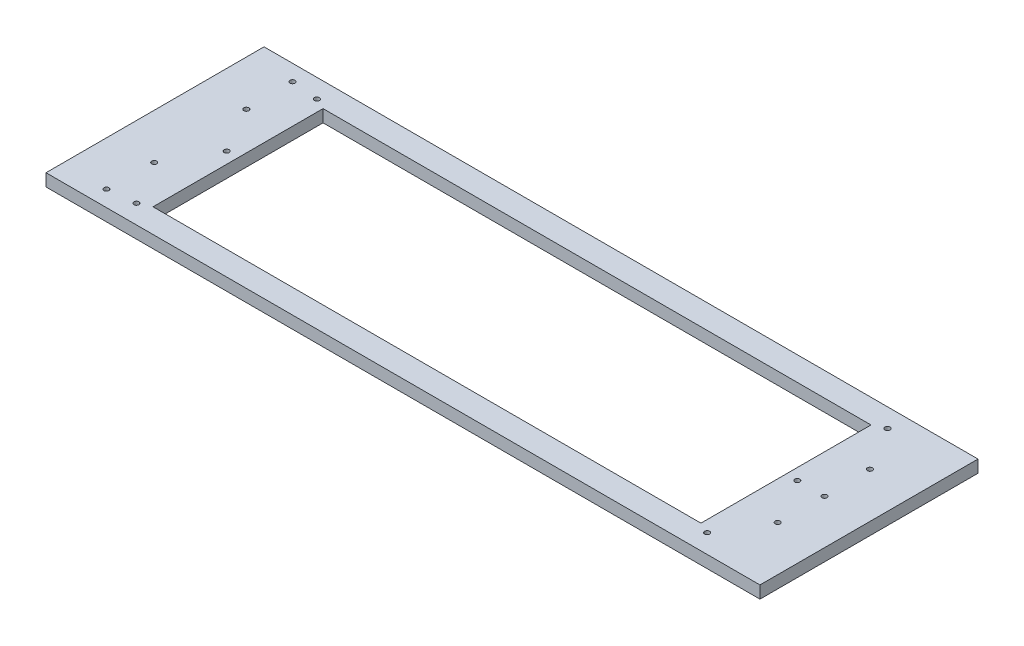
ISO-10303-21;
HEADER;
FILE_DESCRIPTION(('STEP AP214'),'2;1');
FILE_NAME('part.step','',(''),(''),'','','');
FILE_SCHEMA(('AUTOMOTIVE_DESIGN { 1 0 10303 214 1 1 1 1 }'));
ENDSEC;
DATA;
#1=APPLICATION_CONTEXT('core data for automotive mechanical design processes');
#2=APPLICATION_PROTOCOL_DEFINITION('international standard','automotive_design',2000,#1);
#3=PRODUCT_CONTEXT('',#1,'mechanical');
#4=PRODUCT('Part','Part','',(#3));
#5=PRODUCT_RELATED_PRODUCT_CATEGORY('part','',(#4));
#6=PRODUCT_DEFINITION_FORMATION('','',#4);
#7=PRODUCT_DEFINITION_CONTEXT('part definition',#1,'design');
#8=PRODUCT_DEFINITION('design','',#6,#7);
#9=PRODUCT_DEFINITION_SHAPE('','',#8);
#10=(LENGTH_UNIT() NAMED_UNIT(*) SI_UNIT(.MILLI.,.METRE.));
#11=(NAMED_UNIT(*) PLANE_ANGLE_UNIT() SI_UNIT($,.RADIAN.));
#12=(NAMED_UNIT(*) SI_UNIT($,.STERADIAN.) SOLID_ANGLE_UNIT());
#13=UNCERTAINTY_MEASURE_WITH_UNIT(LENGTH_MEASURE(1.E-05),#10,'distance_accuracy_value','');
#14=(GEOMETRIC_REPRESENTATION_CONTEXT(3) GLOBAL_UNCERTAINTY_ASSIGNED_CONTEXT((#13)) GLOBAL_UNIT_ASSIGNED_CONTEXT((#10,
#11,#12)) REPRESENTATION_CONTEXT('',''));
#15=CARTESIAN_POINT('',(0.,0.,0.));
#16=DIRECTION('',(0.,0.,1.));
#17=DIRECTION('',(1.,0.,0.));
#18=AXIS2_PLACEMENT_3D('',#15,#16,#17);
#19=CARTESIAN_POINT('',(141.7,6.4875,-43.275));
#20=DIRECTION('',(0.,-1.,0.));
#21=DIRECTION('',(0.,0.,-1.));
#22=AXIS2_PLACEMENT_3D('',#19,#20,#21);
#23=PLANE('',#22);
#24=CARTESIAN_POINT('',(124.05,6.48749999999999,0.));
#25=DIRECTION('',(0.,-1.,0.));
#26=DIRECTION('',(0.,0.,-1.));
#27=AXIS2_PLACEMENT_3D('',#24,#25,#26);
#28=CIRCLE('',#27,0.999999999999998);
#29=CARTESIAN_POINT('',(124.05,6.4875,-0.999999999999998));
#30=VERTEX_POINT('',#29);
#31=EDGE_CURVE('E478',#30,#30,#28,.T.);
#32=ORIENTED_EDGE('',*,*,#31,.T.);
#33=EDGE_LOOP('',(#32));
#34=FACE_BOUND('',#33,.T.);
#35=CARTESIAN_POINT('',(-124.05,6.48749999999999,36.925));
#36=DIRECTION('',(0.,-1.,0.));
#37=DIRECTION('',(0.,0.,-1.));
#38=AXIS2_PLACEMENT_3D('',#35,#36,#37);
#39=CIRCLE('',#38,0.999999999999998);
#40=CARTESIAN_POINT('',(-124.05,6.4875,35.925));
#41=VERTEX_POINT('',#40);
#42=EDGE_CURVE('E472',#41,#41,#39,.T.);
#43=ORIENTED_EDGE('',*,*,#42,.T.);
#44=EDGE_LOOP('',(#43));
#45=FACE_BOUND('',#44,.T.);
#46=CARTESIAN_POINT('',(-124.05,6.48749999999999,-36.925));
#47=DIRECTION('',(0.,-1.,0.));
#48=DIRECTION('',(0.,0.,-1.));
#49=AXIS2_PLACEMENT_3D('',#46,#47,#48);
#50=CIRCLE('',#49,0.999999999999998);
#51=CARTESIAN_POINT('',(-124.05,6.4875,-37.925));
#52=VERTEX_POINT('',#51);
#53=EDGE_CURVE('E466',#52,#52,#50,.T.);
#54=ORIENTED_EDGE('',*,*,#53,.T.);
#55=EDGE_LOOP('',(#54));
#56=FACE_BOUND('',#55,.T.);
#57=CARTESIAN_POINT('',(113.25,6.48749999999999,35.8125));
#58=DIRECTION('',(0.,-1.,0.));
#59=DIRECTION('',(0.,0.,-1.));
#60=AXIS2_PLACEMENT_3D('',#57,#58,#59);
#61=CIRCLE('',#60,0.999999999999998);
#62=CARTESIAN_POINT('',(113.25,6.4875,34.8125));
#63=VERTEX_POINT('',#62);
#64=EDGE_CURVE('E460',#63,#63,#61,.T.);
#65=ORIENTED_EDGE('',*,*,#64,.T.);
#66=EDGE_LOOP('',(#65));
#67=FACE_BOUND('',#66,.T.);
#68=CARTESIAN_POINT('',(113.25,6.48749999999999,0.));
#69=DIRECTION('',(0.,-1.,0.));
#70=DIRECTION('',(0.,0.,-1.));
#71=AXIS2_PLACEMENT_3D('',#68,#69,#70);
#72=CIRCLE('',#71,0.999999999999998);
#73=CARTESIAN_POINT('',(113.25,6.4875,-0.999999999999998));
#74=VERTEX_POINT('',#73);
#75=EDGE_CURVE('E454',#74,#74,#72,.T.);
#76=ORIENTED_EDGE('',*,*,#75,.T.);
#77=EDGE_LOOP('',(#76));
#78=FACE_BOUND('',#77,.T.);
#79=CARTESIAN_POINT('',(113.25,6.48749999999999,-35.8125));
#80=DIRECTION('',(0.,-1.,0.));
#81=DIRECTION('',(0.,0.,-1.));
#82=AXIS2_PLACEMENT_3D('',#79,#80,#81);
#83=CIRCLE('',#82,0.999999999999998);
#84=CARTESIAN_POINT('',(113.25,6.4875,-36.8125));
#85=VERTEX_POINT('',#84);
#86=EDGE_CURVE('E448',#85,#85,#83,.T.);
#87=ORIENTED_EDGE('',*,*,#86,.T.);
#88=EDGE_LOOP('',(#87));
#89=FACE_BOUND('',#88,.T.);
#90=CARTESIAN_POINT('',(-113.25,6.48749999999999,-35.8125));
#91=DIRECTION('',(0.,-1.,0.));
#92=DIRECTION('',(0.,0.,-1.));
#93=AXIS2_PLACEMENT_3D('',#90,#91,#92);
#94=CIRCLE('',#93,0.999999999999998);
#95=CARTESIAN_POINT('',(-113.25,6.4875,-36.8125));
#96=VERTEX_POINT('',#95);
#97=EDGE_CURVE('E442',#96,#96,#94,.T.);
#98=ORIENTED_EDGE('',*,*,#97,.T.);
#99=EDGE_LOOP('',(#98));
#100=FACE_BOUND('',#99,.T.);
#101=CARTESIAN_POINT('',(-113.25,6.48749999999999,35.8125));
#102=DIRECTION('',(0.,-1.,0.));
#103=DIRECTION('',(0.,0.,-1.));
#104=AXIS2_PLACEMENT_3D('',#101,#102,#103);
#105=CIRCLE('',#104,0.999999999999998);
#106=CARTESIAN_POINT('',(-113.25,6.4875,34.8125));
#107=VERTEX_POINT('',#106);
#108=EDGE_CURVE('E434',#107,#107,#105,.T.);
#109=ORIENTED_EDGE('',*,*,#108,.T.);
#110=EDGE_LOOP('',(#109));
#111=FACE_BOUND('',#110,.T.);
#112=CARTESIAN_POINT('',(-113.25,6.48749999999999,0.));
#113=DIRECTION('',(0.,-1.,0.));
#114=DIRECTION('',(0.,0.,-1.));
#115=AXIS2_PLACEMENT_3D('',#112,#113,#114);
#116=CIRCLE('',#115,0.999999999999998);
#117=CARTESIAN_POINT('',(-113.25,6.4875,-0.999999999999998));
#118=VERTEX_POINT('',#117);
#119=EDGE_CURVE('E428',#118,#118,#116,.T.);
#120=ORIENTED_EDGE('',*,*,#119,.T.);
#121=EDGE_LOOP('',(#120));
#122=FACE_BOUND('',#121,.T.);
#123=CARTESIAN_POINT('',(123.75,6.4875,-18.3));
#124=DIRECTION('',(0.,1.,0.));
#125=DIRECTION('',(0.,0.,-1.));
#126=AXIS2_PLACEMENT_3D('',#123,#124,#125);
#127=CIRCLE('',#126,0.999999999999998);
#128=CARTESIAN_POINT('',(123.75,6.4875,-19.3));
#129=VERTEX_POINT('',#128);
#130=EDGE_CURVE('E180',#129,#129,#127,.T.);
#131=ORIENTED_EDGE('',*,*,#130,.F.);
#132=EDGE_LOOP('',(#131));
#133=FACE_BOUND('',#132,.T.);
#134=CARTESIAN_POINT('',(123.75,6.4875,18.3));
#135=DIRECTION('',(0.,1.,0.));
#136=DIRECTION('',(0.,0.,-1.));
#137=AXIS2_PLACEMENT_3D('',#134,#135,#136);
#138=CIRCLE('',#137,0.999999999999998);
#139=CARTESIAN_POINT('',(123.75,6.4875,17.3));
#140=VERTEX_POINT('',#139);
#141=EDGE_CURVE('E170',#140,#140,#138,.T.);
#142=ORIENTED_EDGE('',*,*,#141,.F.);
#143=EDGE_LOOP('',(#142));
#144=FACE_BOUND('',#143,.T.);
#145=CARTESIAN_POINT('',(-123.75,6.4875,18.3));
#146=DIRECTION('',(0.,1.,0.));
#147=DIRECTION('',(0.,0.,1.));
#148=AXIS2_PLACEMENT_3D('',#145,#146,#147);
#149=CIRCLE('',#148,0.999999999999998);
#150=CARTESIAN_POINT('',(-123.75,6.4875,19.3));
#151=VERTEX_POINT('',#150);
#152=EDGE_CURVE('E167',#151,#151,#149,.T.);
#153=ORIENTED_EDGE('',*,*,#152,.F.);
#154=EDGE_LOOP('',(#153));
#155=FACE_BOUND('',#154,.T.);
#156=CARTESIAN_POINT('',(-123.75,6.4875,-18.3));
#157=DIRECTION('',(0.,1.,0.));
#158=DIRECTION('',(0.,0.,1.));
#159=AXIS2_PLACEMENT_3D('',#156,#157,#158);
#160=CIRCLE('',#159,0.999999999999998);
#161=CARTESIAN_POINT('',(-123.75,6.4875,-17.3));
#162=VERTEX_POINT('',#161);
#163=EDGE_CURVE('E164',#162,#162,#160,.T.);
#164=ORIENTED_EDGE('',*,*,#163,.F.);
#165=EDGE_LOOP('',(#164));
#166=FACE_BOUND('',#165,.T.);
#167=DIRECTION('',(-1.,0.,0.));
#168=VECTOR('',#167,1.);
#169=CARTESIAN_POINT('',(-141.7,6.4875,-43.275));
#170=LINE('',#169,#168);
#171=CARTESIAN_POINT('',(141.7,6.4875,-43.275));
#172=VERTEX_POINT('',#171);
#173=CARTESIAN_POINT('',(-141.7,6.4875,-43.275));
#174=VERTEX_POINT('',#173);
#175=EDGE_CURVE('E137',#172,#174,#170,.T.);
#176=ORIENTED_EDGE('',*,*,#175,.T.);
#177=DIRECTION('',(0.,0.,1.));
#178=VECTOR('',#177,1.);
#179=CARTESIAN_POINT('',(-141.7,6.4875,-43.275));
#180=LINE('',#179,#178);
#181=CARTESIAN_POINT('',(-141.7,6.4875,43.275));
#182=VERTEX_POINT('',#181);
#183=EDGE_CURVE('E140',#174,#182,#180,.T.);
#184=ORIENTED_EDGE('',*,*,#183,.T.);
#185=DIRECTION('',(1.,0.,0.));
#186=VECTOR('',#185,1.);
#187=CARTESIAN_POINT('',(-141.7,6.4875,43.275));
#188=LINE('',#187,#186);
#189=CARTESIAN_POINT('',(141.7,6.4875,43.275));
#190=VERTEX_POINT('',#189);
#191=EDGE_CURVE('E143',#182,#190,#188,.T.);
#192=ORIENTED_EDGE('',*,*,#191,.T.);
#193=DIRECTION('',(0.,0.,-1.));
#194=VECTOR('',#193,1.);
#195=CARTESIAN_POINT('',(141.7,6.4875,-43.275));
#196=LINE('',#195,#194);
#197=EDGE_CURVE('E145',#190,#172,#196,.T.);
#198=ORIENTED_EDGE('',*,*,#197,.T.);
#199=EDGE_LOOP('',(#176,#184,#192,#198));
#200=FACE_BOUND('',#199,.T.);
#201=DIRECTION('',(-1.,0.,0.));
#202=VECTOR('',#201,1.);
#203=CARTESIAN_POINT('',(-108.75,6.4875,-33.75));
#204=LINE('',#203,#202);
#205=CARTESIAN_POINT('',(108.75,6.4875,-33.75));
#206=VERTEX_POINT('',#205);
#207=CARTESIAN_POINT('',(-108.75,6.4875,-33.75));
#208=VERTEX_POINT('',#207);
#209=EDGE_CURVE('E99',#206,#208,#204,.T.);
#210=ORIENTED_EDGE('',*,*,#209,.F.);
#211=DIRECTION('',(0.,0.,-1.));
#212=VECTOR('',#211,1.);
#213=CARTESIAN_POINT('',(108.75,6.4875,-33.75));
#214=LINE('',#213,#212);
#215=CARTESIAN_POINT('',(108.75,6.4875,33.75));
#216=VERTEX_POINT('',#215);
#217=EDGE_CURVE('E121',#216,#206,#214,.T.);
#218=ORIENTED_EDGE('',*,*,#217,.F.);
#219=DIRECTION('',(1.,0.,0.));
#220=VECTOR('',#219,1.);
#221=CARTESIAN_POINT('',(-108.75,6.4875,33.75));
#222=LINE('',#221,#220);
#223=CARTESIAN_POINT('',(-108.75,6.4875,33.75));
#224=VERTEX_POINT('',#223);
#225=EDGE_CURVE('E119',#224,#216,#222,.T.);
#226=ORIENTED_EDGE('',*,*,#225,.F.);
#227=DIRECTION('',(0.,0.,1.));
#228=VECTOR('',#227,1.);
#229=CARTESIAN_POINT('',(-108.75,6.4875,-33.75));
#230=LINE('',#229,#228);
#231=EDGE_CURVE('E107',#208,#224,#230,.T.);
#232=ORIENTED_EDGE('',*,*,#231,.F.);
#233=EDGE_LOOP('',(#210,#218,#226,#232));
#234=FACE_BOUND('',#233,.T.);
#235=ADVANCED_FACE('F32',(#34,#45,#56,#67,#78,#89,#100,#111,#122,#133,#144,#155,#166,#200,#234),
#23,.F.);
#236=CARTESIAN_POINT('',(141.7,1.58749999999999,-43.275));
#237=DIRECTION('',(0.,-1.,0.));
#238=DIRECTION('',(0.,0.,-1.));
#239=AXIS2_PLACEMENT_3D('',#236,#237,#238);
#240=PLANE('',#239);
#241=CARTESIAN_POINT('',(124.05,1.58749999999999,0.));
#242=DIRECTION('',(0.,-1.,0.));
#243=DIRECTION('',(0.,0.,-1.));
#244=AXIS2_PLACEMENT_3D('',#241,#242,#243);
#245=CIRCLE('',#244,0.999999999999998);
#246=CARTESIAN_POINT('',(124.05,1.5875,-0.999999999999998));
#247=VERTEX_POINT('',#246);
#248=EDGE_CURVE('E481',#247,#247,#245,.T.);
#249=ORIENTED_EDGE('',*,*,#248,.F.);
#250=EDGE_LOOP('',(#249));
#251=FACE_BOUND('',#250,.T.);
#252=CARTESIAN_POINT('',(-124.05,1.58749999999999,36.925));
#253=DIRECTION('',(0.,-1.,0.));
#254=DIRECTION('',(0.,0.,1.));
#255=AXIS2_PLACEMENT_3D('',#252,#253,#254);
#256=CIRCLE('',#255,0.999999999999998);
#257=CARTESIAN_POINT('',(-124.05,1.5875,35.925));
#258=VERTEX_POINT('',#257);
#259=EDGE_CURVE('E475',#258,#258,#256,.T.);
#260=ORIENTED_EDGE('',*,*,#259,.F.);
#261=EDGE_LOOP('',(#260));
#262=FACE_BOUND('',#261,.T.);
#263=CARTESIAN_POINT('',(-124.05,1.58749999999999,-36.925));
#264=DIRECTION('',(0.,-1.,0.));
#265=DIRECTION('',(0.,0.,-1.));
#266=AXIS2_PLACEMENT_3D('',#263,#264,#265);
#267=CIRCLE('',#266,0.999999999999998);
#268=CARTESIAN_POINT('',(-124.05,1.5875,-37.925));
#269=VERTEX_POINT('',#268);
#270=EDGE_CURVE('E469',#269,#269,#267,.T.);
#271=ORIENTED_EDGE('',*,*,#270,.F.);
#272=EDGE_LOOP('',(#271));
#273=FACE_BOUND('',#272,.T.);
#274=CARTESIAN_POINT('',(113.25,1.58749999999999,35.8125));
#275=DIRECTION('',(0.,-1.,0.));
#276=DIRECTION('',(0.,0.,1.));
#277=AXIS2_PLACEMENT_3D('',#274,#275,#276);
#278=CIRCLE('',#277,0.999999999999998);
#279=CARTESIAN_POINT('',(113.25,1.5875,34.8125));
#280=VERTEX_POINT('',#279);
#281=EDGE_CURVE('E463',#280,#280,#278,.T.);
#282=ORIENTED_EDGE('',*,*,#281,.F.);
#283=EDGE_LOOP('',(#282));
#284=FACE_BOUND('',#283,.T.);
#285=CARTESIAN_POINT('',(113.25,1.58749999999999,0.));
#286=DIRECTION('',(0.,-1.,0.));
#287=DIRECTION('',(0.,0.,1.));
#288=AXIS2_PLACEMENT_3D('',#285,#286,#287);
#289=CIRCLE('',#288,0.999999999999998);
#290=CARTESIAN_POINT('',(113.25,1.5875,-0.999999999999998));
#291=VERTEX_POINT('',#290);
#292=EDGE_CURVE('E457',#291,#291,#289,.T.);
#293=ORIENTED_EDGE('',*,*,#292,.F.);
#294=EDGE_LOOP('',(#293));
#295=FACE_BOUND('',#294,.T.);
#296=CARTESIAN_POINT('',(113.25,1.58749999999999,-35.8125));
#297=DIRECTION('',(0.,-1.,0.));
#298=DIRECTION('',(0.,0.,-1.));
#299=AXIS2_PLACEMENT_3D('',#296,#297,#298);
#300=CIRCLE('',#299,0.999999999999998);
#301=CARTESIAN_POINT('',(113.25,1.5875,-36.8125));
#302=VERTEX_POINT('',#301);
#303=EDGE_CURVE('E451',#302,#302,#300,.T.);
#304=ORIENTED_EDGE('',*,*,#303,.F.);
#305=EDGE_LOOP('',(#304));
#306=FACE_BOUND('',#305,.T.);
#307=CARTESIAN_POINT('',(-113.25,1.58749999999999,-35.8125));
#308=DIRECTION('',(0.,-1.,0.));
#309=DIRECTION('',(0.,0.,1.));
#310=AXIS2_PLACEMENT_3D('',#307,#308,#309);
#311=CIRCLE('',#310,0.999999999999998);
#312=CARTESIAN_POINT('',(-113.25,1.5875,-36.8125));
#313=VERTEX_POINT('',#312);
#314=EDGE_CURVE('E445',#313,#313,#311,.T.);
#315=ORIENTED_EDGE('',*,*,#314,.F.);
#316=EDGE_LOOP('',(#315));
#317=FACE_BOUND('',#316,.T.);
#318=CARTESIAN_POINT('',(-113.25,1.58749999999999,35.8125));
#319=DIRECTION('',(0.,-1.,0.));
#320=DIRECTION('',(0.,0.,-1.));
#321=AXIS2_PLACEMENT_3D('',#318,#319,#320);
#322=CIRCLE('',#321,0.999999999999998);
#323=CARTESIAN_POINT('',(-113.25,1.5875,34.8125));
#324=VERTEX_POINT('',#323);
#325=EDGE_CURVE('E439',#324,#324,#322,.T.);
#326=ORIENTED_EDGE('',*,*,#325,.F.);
#327=EDGE_LOOP('',(#326));
#328=FACE_BOUND('',#327,.T.);
#329=CARTESIAN_POINT('',(-113.25,1.58749999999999,0.));
#330=DIRECTION('',(0.,-1.,0.));
#331=DIRECTION('',(0.,0.,-1.));
#332=AXIS2_PLACEMENT_3D('',#329,#330,#331);
#333=CIRCLE('',#332,0.999999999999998);
#334=CARTESIAN_POINT('',(-113.25,1.5875,-0.999999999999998));
#335=VERTEX_POINT('',#334);
#336=EDGE_CURVE('E430',#335,#335,#333,.T.);
#337=ORIENTED_EDGE('',*,*,#336,.F.);
#338=EDGE_LOOP('',(#337));
#339=FACE_BOUND('',#338,.T.);
#340=CARTESIAN_POINT('',(123.75,1.58749999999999,-18.3));
#341=DIRECTION('',(0.,-1.,0.));
#342=DIRECTION('',(0.,0.,-1.));
#343=AXIS2_PLACEMENT_3D('',#340,#341,#342);
#344=CIRCLE('',#343,0.999999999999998);
#345=CARTESIAN_POINT('',(123.75,1.58749999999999,-19.3));
#346=VERTEX_POINT('',#345);
#347=EDGE_CURVE('E36',#346,#346,#344,.T.);
#348=ORIENTED_EDGE('',*,*,#347,.F.);
#349=EDGE_LOOP('',(#348));
#350=FACE_BOUND('',#349,.T.);
#351=CARTESIAN_POINT('',(123.75,1.58749999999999,18.3));
#352=DIRECTION('',(0.,-1.,0.));
#353=DIRECTION('',(0.,0.,-1.));
#354=AXIS2_PLACEMENT_3D('',#351,#352,#353);
#355=CIRCLE('',#354,0.999999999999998);
#356=CARTESIAN_POINT('',(123.75,1.58749999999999,17.3));
#357=VERTEX_POINT('',#356);
#358=EDGE_CURVE('E168',#357,#357,#355,.T.);
#359=ORIENTED_EDGE('',*,*,#358,.F.);
#360=EDGE_LOOP('',(#359));
#361=FACE_BOUND('',#360,.T.);
#362=CARTESIAN_POINT('',(-123.75,1.58749999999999,18.3));
#363=DIRECTION('',(0.,-1.,0.));
#364=DIRECTION('',(0.,0.,-1.));
#365=AXIS2_PLACEMENT_3D('',#362,#363,#364);
#366=CIRCLE('',#365,0.999999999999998);
#367=CARTESIAN_POINT('',(-123.75,1.58749999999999,17.3));
#368=VERTEX_POINT('',#367);
#369=EDGE_CURVE('E165',#368,#368,#366,.T.);
#370=ORIENTED_EDGE('',*,*,#369,.F.);
#371=EDGE_LOOP('',(#370));
#372=FACE_BOUND('',#371,.T.);
#373=CARTESIAN_POINT('',(-123.75,1.58749999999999,-18.3));
#374=DIRECTION('',(0.,-1.,0.));
#375=DIRECTION('',(0.,0.,-1.));
#376=AXIS2_PLACEMENT_3D('',#373,#374,#375);
#377=CIRCLE('',#376,0.999999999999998);
#378=CARTESIAN_POINT('',(-123.75,1.58749999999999,-19.3));
#379=VERTEX_POINT('',#378);
#380=EDGE_CURVE('E127',#379,#379,#377,.T.);
#381=ORIENTED_EDGE('',*,*,#380,.F.);
#382=EDGE_LOOP('',(#381));
#383=FACE_BOUND('',#382,.T.);
#384=DIRECTION('',(-1.,0.,0.));
#385=VECTOR('',#384,1.);
#386=CARTESIAN_POINT('',(-141.7,1.58749999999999,-43.275));
#387=LINE('',#386,#385);
#388=CARTESIAN_POINT('',(141.7,1.58749999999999,-43.275));
#389=VERTEX_POINT('',#388);
#390=CARTESIAN_POINT('',(-141.7,1.58749999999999,-43.275));
#391=VERTEX_POINT('',#390);
#392=EDGE_CURVE('E115',#389,#391,#387,.T.);
#393=ORIENTED_EDGE('',*,*,#392,.F.);
#394=DIRECTION('',(0.,0.,-1.));
#395=VECTOR('',#394,1.);
#396=CARTESIAN_POINT('',(141.7,1.58749999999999,-43.275));
#397=LINE('',#396,#395);
#398=CARTESIAN_POINT('',(141.7,1.58749999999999,43.275));
#399=VERTEX_POINT('',#398);
#400=EDGE_CURVE('E141',#399,#389,#397,.T.);
#401=ORIENTED_EDGE('',*,*,#400,.F.);
#402=DIRECTION('',(1.,0.,0.));
#403=VECTOR('',#402,1.);
#404=CARTESIAN_POINT('',(-141.7,1.58749999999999,43.275));
#405=LINE('',#404,#403);
#406=CARTESIAN_POINT('',(-141.7,1.58749999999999,43.275));
#407=VERTEX_POINT('',#406);
#408=EDGE_CURVE('E152',#407,#399,#405,.T.);
#409=ORIENTED_EDGE('',*,*,#408,.F.);
#410=DIRECTION('',(0.,0.,1.));
#411=VECTOR('',#410,1.);
#412=CARTESIAN_POINT('',(-141.7,1.58749999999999,-43.275));
#413=LINE('',#412,#411);
#414=EDGE_CURVE('E150',#391,#407,#413,.T.);
#415=ORIENTED_EDGE('',*,*,#414,.F.);
#416=EDGE_LOOP('',(#393,#401,#409,#415));
#417=FACE_BOUND('',#416,.T.);
#418=DIRECTION('',(0.,0.,-1.));
#419=VECTOR('',#418,1.);
#420=CARTESIAN_POINT('',(108.75,1.58749999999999,-33.75));
#421=LINE('',#420,#419);
#422=CARTESIAN_POINT('',(108.75,1.58749999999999,33.75));
#423=VERTEX_POINT('',#422);
#424=CARTESIAN_POINT('',(108.75,1.58749999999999,-33.75));
#425=VERTEX_POINT('',#424);
#426=EDGE_CURVE('E108',#423,#425,#421,.T.);
#427=ORIENTED_EDGE('',*,*,#426,.T.);
#428=DIRECTION('',(-1.,0.,0.));
#429=VECTOR('',#428,1.);
#430=CARTESIAN_POINT('',(-108.75,1.58749999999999,-33.75));
#431=LINE('',#430,#429);
#432=CARTESIAN_POINT('',(-108.75,1.58749999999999,-33.75));
#433=VERTEX_POINT('',#432);
#434=EDGE_CURVE('E57',#425,#433,#431,.T.);
#435=ORIENTED_EDGE('',*,*,#434,.T.);
#436=DIRECTION('',(0.,0.,1.));
#437=VECTOR('',#436,1.);
#438=CARTESIAN_POINT('',(-108.75,1.58749999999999,-33.75));
#439=LINE('',#438,#437);
#440=CARTESIAN_POINT('',(-108.75,1.58749999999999,33.75));
#441=VERTEX_POINT('',#440);
#442=EDGE_CURVE('E114',#433,#441,#439,.T.);
#443=ORIENTED_EDGE('',*,*,#442,.T.);
#444=DIRECTION('',(1.,0.,0.));
#445=VECTOR('',#444,1.);
#446=CARTESIAN_POINT('',(-108.75,1.58749999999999,33.75));
#447=LINE('',#446,#445);
#448=EDGE_CURVE('E129',#441,#423,#447,.T.);
#449=ORIENTED_EDGE('',*,*,#448,.T.);
#450=EDGE_LOOP('',(#427,#435,#443,#449));
#451=FACE_BOUND('',#450,.T.);
#452=ADVANCED_FACE('F190',(#251,#262,#273,#284,#295,#306,#317,#328,#339,#350,#361,#372,#383,
#417,#451),#240,.T.);
#453=CARTESIAN_POINT('',(-141.7,6.4875,-43.275));
#454=DIRECTION('',(0.,0.,1.));
#455=DIRECTION('',(1.,0.,0.));
#456=AXIS2_PLACEMENT_3D('',#453,#454,#455);
#457=PLANE('',#456);
#458=ORIENTED_EDGE('',*,*,#392,.T.);
#459=DIRECTION('',(0.,-1.,0.));
#460=VECTOR('',#459,1.);
#461=CARTESIAN_POINT('',(-141.7,6.4875,-43.275));
#462=LINE('',#461,#460);
#463=EDGE_CURVE('E12',#174,#391,#462,.T.);
#464=ORIENTED_EDGE('',*,*,#463,.F.);
#465=ORIENTED_EDGE('',*,*,#175,.F.);
#466=DIRECTION('',(0.,-1.,0.));
#467=VECTOR('',#466,1.);
#468=CARTESIAN_POINT('',(141.7,6.4875,-43.275));
#469=LINE('',#468,#467);
#470=EDGE_CURVE('E147',#172,#389,#469,.T.);
#471=ORIENTED_EDGE('',*,*,#470,.T.);
#472=EDGE_LOOP('',(#458,#464,#465,#471));
#473=FACE_BOUND('',#472,.T.);
#474=ADVANCED_FACE('F34',(#473),#457,.F.);
#475=CARTESIAN_POINT('',(-141.7,6.4875,-43.275));
#476=DIRECTION('',(1.,0.,0.));
#477=DIRECTION('',(0.,0.,-1.));
#478=AXIS2_PLACEMENT_3D('',#475,#476,#477);
#479=PLANE('',#478);
#480=ORIENTED_EDGE('',*,*,#414,.T.);
#481=DIRECTION('',(0.,-1.,0.));
#482=VECTOR('',#481,1.);
#483=CARTESIAN_POINT('',(-141.7,6.4875,43.275));
#484=LINE('',#483,#482);
#485=EDGE_CURVE('E41',#182,#407,#484,.T.);
#486=ORIENTED_EDGE('',*,*,#485,.F.);
#487=ORIENTED_EDGE('',*,*,#183,.F.);
#488=ORIENTED_EDGE('',*,*,#463,.T.);
#489=EDGE_LOOP('',(#480,#486,#487,#488));
#490=FACE_BOUND('',#489,.T.);
#491=ADVANCED_FACE('F201',(#490),#479,.F.);
#492=CARTESIAN_POINT('',(-141.7,6.4875,43.275));
#493=DIRECTION('',(0.,0.,-1.));
#494=DIRECTION('',(-1.,0.,0.));
#495=AXIS2_PLACEMENT_3D('',#492,#493,#494);
#496=PLANE('',#495);
#497=ORIENTED_EDGE('',*,*,#408,.T.);
#498=DIRECTION('',(0.,-1.,0.));
#499=VECTOR('',#498,1.);
#500=CARTESIAN_POINT('',(141.7,6.4875,43.275));
#501=LINE('',#500,#499);
#502=EDGE_CURVE('E157',#190,#399,#501,.T.);
#503=ORIENTED_EDGE('',*,*,#502,.F.);
#504=ORIENTED_EDGE('',*,*,#191,.F.);
#505=ORIENTED_EDGE('',*,*,#485,.T.);
#506=EDGE_LOOP('',(#497,#503,#504,#505));
#507=FACE_BOUND('',#506,.T.);
#508=ADVANCED_FACE('F206',(#507),#496,.F.);
#509=CARTESIAN_POINT('',(141.7,6.4875,-43.275));
#510=DIRECTION('',(-1.,0.,0.));
#511=DIRECTION('',(0.,0.,1.));
#512=AXIS2_PLACEMENT_3D('',#509,#510,#511);
#513=PLANE('',#512);
#514=ORIENTED_EDGE('',*,*,#400,.T.);
#515=ORIENTED_EDGE('',*,*,#470,.F.);
#516=ORIENTED_EDGE('',*,*,#197,.F.);
#517=ORIENTED_EDGE('',*,*,#502,.T.);
#518=EDGE_LOOP('',(#514,#515,#516,#517));
#519=FACE_BOUND('',#518,.T.);
#520=ADVANCED_FACE('F209',(#519),#513,.F.);
#521=CARTESIAN_POINT('',(-108.75,6.4875,-33.75));
#522=DIRECTION('',(0.,0.,1.));
#523=DIRECTION('',(1.,0.,0.));
#524=AXIS2_PLACEMENT_3D('',#521,#522,#523);
#525=PLANE('',#524);
#526=ORIENTED_EDGE('',*,*,#434,.F.);
#527=DIRECTION('',(0.,-1.,0.));
#528=VECTOR('',#527,1.);
#529=CARTESIAN_POINT('',(108.75,6.4875,-33.75));
#530=LINE('',#529,#528);
#531=EDGE_CURVE('E103',#206,#425,#530,.T.);
#532=ORIENTED_EDGE('',*,*,#531,.F.);
#533=ORIENTED_EDGE('',*,*,#209,.T.);
#534=DIRECTION('',(0.,-1.,0.));
#535=VECTOR('',#534,1.);
#536=CARTESIAN_POINT('',(-108.75,6.4875,-33.75));
#537=LINE('',#536,#535);
#538=EDGE_CURVE('E102',#208,#433,#537,.T.);
#539=ORIENTED_EDGE('',*,*,#538,.T.);
#540=EDGE_LOOP('',(#526,#532,#533,#539));
#541=FACE_BOUND('',#540,.T.);
#542=ADVANCED_FACE('F101',(#541),#525,.T.);
#543=CARTESIAN_POINT('',(-108.75,6.4875,-33.75));
#544=DIRECTION('',(1.,0.,0.));
#545=DIRECTION('',(0.,0.,-1.));
#546=AXIS2_PLACEMENT_3D('',#543,#544,#545);
#547=PLANE('',#546);
#548=ORIENTED_EDGE('',*,*,#442,.F.);
#549=ORIENTED_EDGE('',*,*,#538,.F.);
#550=ORIENTED_EDGE('',*,*,#231,.T.);
#551=DIRECTION('',(0.,-1.,0.));
#552=VECTOR('',#551,1.);
#553=CARTESIAN_POINT('',(-108.75,6.4875,33.75));
#554=LINE('',#553,#552);
#555=EDGE_CURVE('E116',#224,#441,#554,.T.);
#556=ORIENTED_EDGE('',*,*,#555,.T.);
#557=EDGE_LOOP('',(#548,#549,#550,#556));
#558=FACE_BOUND('',#557,.T.);
#559=ADVANCED_FACE('F111',(#558),#547,.T.);
#560=CARTESIAN_POINT('',(-108.75,6.4875,33.75));
#561=DIRECTION('',(0.,0.,-1.));
#562=DIRECTION('',(-1.,0.,0.));
#563=AXIS2_PLACEMENT_3D('',#560,#561,#562);
#564=PLANE('',#563);
#565=ORIENTED_EDGE('',*,*,#448,.F.);
#566=ORIENTED_EDGE('',*,*,#555,.F.);
#567=ORIENTED_EDGE('',*,*,#225,.T.);
#568=DIRECTION('',(0.,-1.,0.));
#569=VECTOR('',#568,1.);
#570=CARTESIAN_POINT('',(108.75,6.4875,33.75));
#571=LINE('',#570,#569);
#572=EDGE_CURVE('E49',#216,#423,#571,.T.);
#573=ORIENTED_EDGE('',*,*,#572,.T.);
#574=EDGE_LOOP('',(#565,#566,#567,#573));
#575=FACE_BOUND('',#574,.T.);
#576=ADVANCED_FACE('F218',(#575),#564,.T.);
#577=CARTESIAN_POINT('',(108.75,6.4875,-33.75));
#578=DIRECTION('',(-1.,0.,0.));
#579=DIRECTION('',(0.,0.,1.));
#580=AXIS2_PLACEMENT_3D('',#577,#578,#579);
#581=PLANE('',#580);
#582=ORIENTED_EDGE('',*,*,#426,.F.);
#583=ORIENTED_EDGE('',*,*,#572,.F.);
#584=ORIENTED_EDGE('',*,*,#217,.T.);
#585=ORIENTED_EDGE('',*,*,#531,.T.);
#586=EDGE_LOOP('',(#582,#583,#584,#585));
#587=FACE_BOUND('',#586,.T.);
#588=ADVANCED_FACE('F216',(#587),#581,.T.);
#589=CARTESIAN_POINT('',(-123.75,-40.386,-18.3));
#590=DIRECTION('',(0.,1.,0.));
#591=DIRECTION('',(0.,0.,1.));
#592=AXIS2_PLACEMENT_3D('',#589,#590,#591);
#593=CYLINDRICAL_SURFACE('',#592,0.999999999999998);
#594=ORIENTED_EDGE('',*,*,#380,.T.);
#595=EDGE_LOOP('',(#594));
#596=FACE_BOUND('',#595,.T.);
#597=ORIENTED_EDGE('',*,*,#163,.T.);
#598=EDGE_LOOP('',(#597));
#599=FACE_BOUND('',#598,.T.);
#600=ADVANCED_FACE('F186',(#596,#599),#593,.F.);
#601=CARTESIAN_POINT('',(-123.75,-40.386,18.3));
#602=DIRECTION('',(0.,1.,0.));
#603=DIRECTION('',(0.,0.,1.));
#604=AXIS2_PLACEMENT_3D('',#601,#602,#603);
#605=CYLINDRICAL_SURFACE('',#604,0.999999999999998);
#606=ORIENTED_EDGE('',*,*,#369,.T.);
#607=EDGE_LOOP('',(#606));
#608=FACE_BOUND('',#607,.T.);
#609=ORIENTED_EDGE('',*,*,#152,.T.);
#610=EDGE_LOOP('',(#609));
#611=FACE_BOUND('',#610,.T.);
#612=ADVANCED_FACE('F224',(#608,#611),#605,.F.);
#613=CARTESIAN_POINT('',(123.75,-40.386,18.3));
#614=DIRECTION('',(0.,1.,0.));
#615=DIRECTION('',(0.,0.,1.));
#616=AXIS2_PLACEMENT_3D('',#613,#614,#615);
#617=CYLINDRICAL_SURFACE('',#616,0.999999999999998);
#618=ORIENTED_EDGE('',*,*,#358,.T.);
#619=EDGE_LOOP('',(#618));
#620=FACE_BOUND('',#619,.T.);
#621=ORIENTED_EDGE('',*,*,#141,.T.);
#622=EDGE_LOOP('',(#621));
#623=FACE_BOUND('',#622,.T.);
#624=ADVANCED_FACE('F386',(#620,#623),#617,.F.);
#625=CARTESIAN_POINT('',(123.75,-40.386,-18.3));
#626=DIRECTION('',(0.,1.,0.));
#627=DIRECTION('',(0.,0.,1.));
#628=AXIS2_PLACEMENT_3D('',#625,#626,#627);
#629=CYLINDRICAL_SURFACE('',#628,0.999999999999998);
#630=ORIENTED_EDGE('',*,*,#347,.T.);
#631=EDGE_LOOP('',(#630));
#632=FACE_BOUND('',#631,.T.);
#633=ORIENTED_EDGE('',*,*,#130,.T.);
#634=EDGE_LOOP('',(#633));
#635=FACE_BOUND('',#634,.T.);
#636=ADVANCED_FACE('F306',(#632,#635),#629,.F.);
#637=CARTESIAN_POINT('',(-113.25,32.4875,0.));
#638=DIRECTION('',(0.,-1.,0.));
#639=DIRECTION('',(0.,0.,-1.));
#640=AXIS2_PLACEMENT_3D('',#637,#638,#639);
#641=CYLINDRICAL_SURFACE('',#640,0.999999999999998);
#642=CARTESIAN_POINT('',(-113.25,1.5875,-0.999999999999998));
#643=CARTESIAN_POINT('',(-113.25,1.63854166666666,-0.999999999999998));
#644=CARTESIAN_POINT('',(-113.25,1.68958333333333,-0.999999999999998));
#645=CARTESIAN_POINT('',(-113.25,1.79166666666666,-0.999999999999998));
#646=CARTESIAN_POINT('',(-113.25,1.84270833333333,-0.999999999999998));
#647=CARTESIAN_POINT('',(-113.25,1.94479166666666,-0.999999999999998));
#648=CARTESIAN_POINT('',(-113.25,1.99583333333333,-0.999999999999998));
#649=CARTESIAN_POINT('',(-113.25,2.09791666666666,-0.999999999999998));
#650=CARTESIAN_POINT('',(-113.25,2.14895833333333,-0.999999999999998));
#651=CARTESIAN_POINT('',(-113.25,2.25104166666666,-0.999999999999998));
#652=CARTESIAN_POINT('',(-113.25,2.30208333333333,-0.999999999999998));
#653=CARTESIAN_POINT('',(-113.25,2.40416666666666,-0.999999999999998));
#654=CARTESIAN_POINT('',(-113.25,2.45520833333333,-0.999999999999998));
#655=CARTESIAN_POINT('',(-113.25,2.55729166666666,-0.999999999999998));
#656=CARTESIAN_POINT('',(-113.25,2.60833333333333,-0.999999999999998));
#657=CARTESIAN_POINT('',(-113.25,2.71041666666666,-0.999999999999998));
#658=CARTESIAN_POINT('',(-113.25,2.76145833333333,-0.999999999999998));
#659=CARTESIAN_POINT('',(-113.25,2.86354166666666,-0.999999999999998));
#660=CARTESIAN_POINT('',(-113.25,2.91458333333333,-0.999999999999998));
#661=CARTESIAN_POINT('',(-113.25,3.01666666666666,-0.999999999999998));
#662=CARTESIAN_POINT('',(-113.25,3.06770833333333,-0.999999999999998));
#663=CARTESIAN_POINT('',(-113.25,3.16979166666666,-0.999999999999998));
#664=CARTESIAN_POINT('',(-113.25,3.22083333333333,-0.999999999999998));
#665=CARTESIAN_POINT('',(-113.25,3.32291666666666,-0.999999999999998));
#666=CARTESIAN_POINT('',(-113.25,3.37395833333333,-0.999999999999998));
#667=CARTESIAN_POINT('',(-113.25,3.47604166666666,-0.999999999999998));
#668=CARTESIAN_POINT('',(-113.25,3.52708333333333,-0.999999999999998));
#669=CARTESIAN_POINT('',(-113.25,3.62916666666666,-0.999999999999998));
#670=CARTESIAN_POINT('',(-113.25,3.68020833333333,-0.999999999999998));
#671=CARTESIAN_POINT('',(-113.25,3.78229166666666,-0.999999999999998));
#672=CARTESIAN_POINT('',(-113.25,3.83333333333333,-0.999999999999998));
#673=CARTESIAN_POINT('',(-113.25,3.93541666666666,-0.999999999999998));
#674=CARTESIAN_POINT('',(-113.25,3.98645833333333,-0.999999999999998));
#675=CARTESIAN_POINT('',(-113.25,4.08854166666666,-0.999999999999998));
#676=CARTESIAN_POINT('',(-113.25,4.13958333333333,-0.999999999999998));
#677=CARTESIAN_POINT('',(-113.25,4.24166666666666,-0.999999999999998));
#678=CARTESIAN_POINT('',(-113.25,4.29270833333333,-0.999999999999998));
#679=CARTESIAN_POINT('',(-113.25,4.39479166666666,-0.999999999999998));
#680=CARTESIAN_POINT('',(-113.25,4.44583333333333,-0.999999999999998));
#681=CARTESIAN_POINT('',(-113.25,4.54791666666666,-0.999999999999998));
#682=CARTESIAN_POINT('',(-113.25,4.59895833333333,-0.999999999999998));
#683=CARTESIAN_POINT('',(-113.25,4.70104166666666,-0.999999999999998));
#684=CARTESIAN_POINT('',(-113.25,4.75208333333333,-0.999999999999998));
#685=CARTESIAN_POINT('',(-113.25,4.85416666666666,-0.999999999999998));
#686=CARTESIAN_POINT('',(-113.25,4.90520833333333,-0.999999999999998));
#687=CARTESIAN_POINT('',(-113.25,5.00729166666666,-0.999999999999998));
#688=CARTESIAN_POINT('',(-113.25,5.05833333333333,-0.999999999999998));
#689=CARTESIAN_POINT('',(-113.25,5.16041666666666,-0.999999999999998));
#690=CARTESIAN_POINT('',(-113.25,5.21145833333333,-0.999999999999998));
#691=CARTESIAN_POINT('',(-113.25,5.31354166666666,-0.999999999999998));
#692=CARTESIAN_POINT('',(-113.25,5.36458333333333,-0.999999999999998));
#693=CARTESIAN_POINT('',(-113.25,5.46666666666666,-0.999999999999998));
#694=CARTESIAN_POINT('',(-113.25,5.51770833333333,-0.999999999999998));
#695=CARTESIAN_POINT('',(-113.25,5.61979166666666,-0.999999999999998));
#696=CARTESIAN_POINT('',(-113.25,5.67083333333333,-0.999999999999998));
#697=CARTESIAN_POINT('',(-113.25,5.77291666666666,-0.999999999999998));
#698=CARTESIAN_POINT('',(-113.25,5.82395833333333,-0.999999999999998));
#699=CARTESIAN_POINT('',(-113.25,5.92604166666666,-0.999999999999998));
#700=CARTESIAN_POINT('',(-113.25,5.97708333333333,-0.999999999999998));
#701=CARTESIAN_POINT('',(-113.25,6.07916666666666,-0.999999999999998));
#702=CARTESIAN_POINT('',(-113.25,6.13020833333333,-0.999999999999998));
#703=CARTESIAN_POINT('',(-113.25,6.23229166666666,-0.999999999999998));
#704=CARTESIAN_POINT('',(-113.25,6.28333333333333,-0.999999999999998));
#705=CARTESIAN_POINT('',(-113.25,6.38541666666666,-0.999999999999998));
#706=CARTESIAN_POINT('',(-113.25,6.43645833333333,-0.999999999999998));
#707=CARTESIAN_POINT('',(-113.25,6.4875,-0.999999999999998));
#708=B_SPLINE_CURVE_WITH_KNOTS('',3,(#642,#643,#644,#645,#646,#647,#648,#649,#650,#651,#652,
#653,#654,#655,#656,#657,#658,#659,#660,#661,#662,#663,#664,#665,#666,#667,#668,#669,#670,#671,
#672,#673,#674,#675,#676,#677,#678,#679,#680,#681,#682,#683,#684,#685,#686,#687,#688,#689,#690,
#691,#692,#693,#694,#695,#696,#697,#698,#699,#700,#701,#702,#703,#704,#705,#706,#707),
.UNSPECIFIED.,.F.,.F.,(4,2,2,2,2,2,2,2,2,2,2,2,2,2,2,2,2,2,2,2,2,2,2,2,2,2,2,2,2,2,2,2,4),(0.,
0.153125,0.306250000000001,0.459375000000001,0.612500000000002,0.765624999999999,
0.918749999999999,1.071875,1.225,1.378125,1.53125,1.684375,1.8375,1.990625,2.14375,2.296875,
2.45,2.603125,2.75625,2.909375,3.0625,3.215625,3.36875,3.521875,3.675,3.828125,3.98125,4.134375,
4.2875,4.440625,4.59375,4.746875,4.9),.UNSPECIFIED.);
#709=EDGE_CURVE('BSEAM300',#335,#118,#708,.T.);
#710=ORIENTED_EDGE('',*,*,#336,.T.);
#711=ORIENTED_EDGE('',*,*,#119,.F.);
#712=ORIENTED_EDGE('',*,*,#709,.T.);
#713=ORIENTED_EDGE('',*,*,#709,.F.);
#714=EDGE_LOOP('',(#710,#712,#711,#713));
#715=FACE_BOUND('',#714,.T.);
#716=ADVANCED_FACE('F300',(#715),#641,.F.);
#717=CARTESIAN_POINT('',(-113.25,32.4875,35.8125));
#718=DIRECTION('',(0.,-1.,0.));
#719=DIRECTION('',(0.,0.,-1.));
#720=AXIS2_PLACEMENT_3D('',#717,#718,#719);
#721=CYLINDRICAL_SURFACE('',#720,0.999999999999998);
#722=CARTESIAN_POINT('',(-113.25,1.5875,34.8125));
#723=CARTESIAN_POINT('',(-113.25,1.63854166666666,34.8125));
#724=CARTESIAN_POINT('',(-113.25,1.68958333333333,34.8125));
#725=CARTESIAN_POINT('',(-113.25,1.79166666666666,34.8125));
#726=CARTESIAN_POINT('',(-113.25,1.84270833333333,34.8125));
#727=CARTESIAN_POINT('',(-113.25,1.94479166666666,34.8125));
#728=CARTESIAN_POINT('',(-113.25,1.99583333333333,34.8125));
#729=CARTESIAN_POINT('',(-113.25,2.09791666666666,34.8125));
#730=CARTESIAN_POINT('',(-113.25,2.14895833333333,34.8125));
#731=CARTESIAN_POINT('',(-113.25,2.25104166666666,34.8125));
#732=CARTESIAN_POINT('',(-113.25,2.30208333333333,34.8125));
#733=CARTESIAN_POINT('',(-113.25,2.40416666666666,34.8125));
#734=CARTESIAN_POINT('',(-113.25,2.45520833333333,34.8125));
#735=CARTESIAN_POINT('',(-113.25,2.55729166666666,34.8125));
#736=CARTESIAN_POINT('',(-113.25,2.60833333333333,34.8125));
#737=CARTESIAN_POINT('',(-113.25,2.71041666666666,34.8125));
#738=CARTESIAN_POINT('',(-113.25,2.76145833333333,34.8125));
#739=CARTESIAN_POINT('',(-113.25,2.86354166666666,34.8125));
#740=CARTESIAN_POINT('',(-113.25,2.91458333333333,34.8125));
#741=CARTESIAN_POINT('',(-113.25,3.01666666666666,34.8125));
#742=CARTESIAN_POINT('',(-113.25,3.06770833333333,34.8125));
#743=CARTESIAN_POINT('',(-113.25,3.16979166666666,34.8125));
#744=CARTESIAN_POINT('',(-113.25,3.22083333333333,34.8125));
#745=CARTESIAN_POINT('',(-113.25,3.32291666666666,34.8125));
#746=CARTESIAN_POINT('',(-113.25,3.37395833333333,34.8125));
#747=CARTESIAN_POINT('',(-113.25,3.47604166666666,34.8125));
#748=CARTESIAN_POINT('',(-113.25,3.52708333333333,34.8125));
#749=CARTESIAN_POINT('',(-113.25,3.62916666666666,34.8125));
#750=CARTESIAN_POINT('',(-113.25,3.68020833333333,34.8125));
#751=CARTESIAN_POINT('',(-113.25,3.78229166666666,34.8125));
#752=CARTESIAN_POINT('',(-113.25,3.83333333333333,34.8125));
#753=CARTESIAN_POINT('',(-113.25,3.93541666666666,34.8125));
#754=CARTESIAN_POINT('',(-113.25,3.98645833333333,34.8125));
#755=CARTESIAN_POINT('',(-113.25,4.08854166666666,34.8125));
#756=CARTESIAN_POINT('',(-113.25,4.13958333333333,34.8125));
#757=CARTESIAN_POINT('',(-113.25,4.24166666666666,34.8125));
#758=CARTESIAN_POINT('',(-113.25,4.29270833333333,34.8125));
#759=CARTESIAN_POINT('',(-113.25,4.39479166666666,34.8125));
#760=CARTESIAN_POINT('',(-113.25,4.44583333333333,34.8125));
#761=CARTESIAN_POINT('',(-113.25,4.54791666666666,34.8125));
#762=CARTESIAN_POINT('',(-113.25,4.59895833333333,34.8125));
#763=CARTESIAN_POINT('',(-113.25,4.70104166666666,34.8125));
#764=CARTESIAN_POINT('',(-113.25,4.75208333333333,34.8125));
#765=CARTESIAN_POINT('',(-113.25,4.85416666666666,34.8125));
#766=CARTESIAN_POINT('',(-113.25,4.90520833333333,34.8125));
#767=CARTESIAN_POINT('',(-113.25,5.00729166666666,34.8125));
#768=CARTESIAN_POINT('',(-113.25,5.05833333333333,34.8125));
#769=CARTESIAN_POINT('',(-113.25,5.16041666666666,34.8125));
#770=CARTESIAN_POINT('',(-113.25,5.21145833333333,34.8125));
#771=CARTESIAN_POINT('',(-113.25,5.31354166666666,34.8125));
#772=CARTESIAN_POINT('',(-113.25,5.36458333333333,34.8125));
#773=CARTESIAN_POINT('',(-113.25,5.46666666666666,34.8125));
#774=CARTESIAN_POINT('',(-113.25,5.51770833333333,34.8125));
#775=CARTESIAN_POINT('',(-113.25,5.61979166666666,34.8125));
#776=CARTESIAN_POINT('',(-113.25,5.67083333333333,34.8125));
#777=CARTESIAN_POINT('',(-113.25,5.77291666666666,34.8125));
#778=CARTESIAN_POINT('',(-113.25,5.82395833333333,34.8125));
#779=CARTESIAN_POINT('',(-113.25,5.92604166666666,34.8125));
#780=CARTESIAN_POINT('',(-113.25,5.97708333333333,34.8125));
#781=CARTESIAN_POINT('',(-113.25,6.07916666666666,34.8125));
#782=CARTESIAN_POINT('',(-113.25,6.13020833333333,34.8125));
#783=CARTESIAN_POINT('',(-113.25,6.23229166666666,34.8125));
#784=CARTESIAN_POINT('',(-113.25,6.28333333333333,34.8125));
#785=CARTESIAN_POINT('',(-113.25,6.38541666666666,34.8125));
#786=CARTESIAN_POINT('',(-113.25,6.43645833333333,34.8125));
#787=CARTESIAN_POINT('',(-113.25,6.4875,34.8125));
#788=B_SPLINE_CURVE_WITH_KNOTS('',3,(#722,#723,#724,#725,#726,#727,#728,#729,#730,#731,#732,
#733,#734,#735,#736,#737,#738,#739,#740,#741,#742,#743,#744,#745,#746,#747,#748,#749,#750,#751,
#752,#753,#754,#755,#756,#757,#758,#759,#760,#761,#762,#763,#764,#765,#766,#767,#768,#769,#770,
#771,#772,#773,#774,#775,#776,#777,#778,#779,#780,#781,#782,#783,#784,#785,#786,#787),
.UNSPECIFIED.,.F.,.F.,(4,2,2,2,2,2,2,2,2,2,2,2,2,2,2,2,2,2,2,2,2,2,2,2,2,2,2,2,2,2,2,2,4),(0.,
0.153125,0.306250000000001,0.459375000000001,0.612500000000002,0.765624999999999,
0.918749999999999,1.071875,1.225,1.378125,1.53125,1.684375,1.8375,1.990625,2.14375,2.296875,
2.45,2.603125,2.75625,2.909375,3.0625,3.215625,3.36875,3.521875,3.675,3.828125,3.98125,4.134375,
4.2875,4.440625,4.59375,4.746875,4.9),.UNSPECIFIED.);
#789=EDGE_CURVE('BSEAM305',#324,#107,#788,.T.);
#790=ORIENTED_EDGE('',*,*,#325,.T.);
#791=ORIENTED_EDGE('',*,*,#108,.F.);
#792=ORIENTED_EDGE('',*,*,#789,.T.);
#793=ORIENTED_EDGE('',*,*,#789,.F.);
#794=EDGE_LOOP('',(#790,#792,#791,#793));
#795=FACE_BOUND('',#794,.T.);
#796=ADVANCED_FACE('F305',(#795),#721,.F.);
#797=CARTESIAN_POINT('',(-113.25,32.4875,-35.8125));
#798=DIRECTION('',(0.,-1.,0.));
#799=DIRECTION('',(0.,0.,-1.));
#800=AXIS2_PLACEMENT_3D('',#797,#798,#799);
#801=CYLINDRICAL_SURFACE('',#800,0.999999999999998);
#802=CARTESIAN_POINT('',(-113.25,1.5875,-36.8125));
#803=CARTESIAN_POINT('',(-113.25,1.63854166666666,-36.8125));
#804=CARTESIAN_POINT('',(-113.25,1.68958333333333,-36.8125));
#805=CARTESIAN_POINT('',(-113.25,1.79166666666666,-36.8125));
#806=CARTESIAN_POINT('',(-113.25,1.84270833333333,-36.8125));
#807=CARTESIAN_POINT('',(-113.25,1.94479166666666,-36.8125));
#808=CARTESIAN_POINT('',(-113.25,1.99583333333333,-36.8125));
#809=CARTESIAN_POINT('',(-113.25,2.09791666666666,-36.8125));
#810=CARTESIAN_POINT('',(-113.25,2.14895833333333,-36.8125));
#811=CARTESIAN_POINT('',(-113.25,2.25104166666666,-36.8125));
#812=CARTESIAN_POINT('',(-113.25,2.30208333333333,-36.8125));
#813=CARTESIAN_POINT('',(-113.25,2.40416666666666,-36.8125));
#814=CARTESIAN_POINT('',(-113.25,2.45520833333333,-36.8125));
#815=CARTESIAN_POINT('',(-113.25,2.55729166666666,-36.8125));
#816=CARTESIAN_POINT('',(-113.25,2.60833333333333,-36.8125));
#817=CARTESIAN_POINT('',(-113.25,2.71041666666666,-36.8125));
#818=CARTESIAN_POINT('',(-113.25,2.76145833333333,-36.8125));
#819=CARTESIAN_POINT('',(-113.25,2.86354166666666,-36.8125));
#820=CARTESIAN_POINT('',(-113.25,2.91458333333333,-36.8125));
#821=CARTESIAN_POINT('',(-113.25,3.01666666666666,-36.8125));
#822=CARTESIAN_POINT('',(-113.25,3.06770833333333,-36.8125));
#823=CARTESIAN_POINT('',(-113.25,3.16979166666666,-36.8125));
#824=CARTESIAN_POINT('',(-113.25,3.22083333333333,-36.8125));
#825=CARTESIAN_POINT('',(-113.25,3.32291666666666,-36.8125));
#826=CARTESIAN_POINT('',(-113.25,3.37395833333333,-36.8125));
#827=CARTESIAN_POINT('',(-113.25,3.47604166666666,-36.8125));
#828=CARTESIAN_POINT('',(-113.25,3.52708333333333,-36.8125));
#829=CARTESIAN_POINT('',(-113.25,3.62916666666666,-36.8125));
#830=CARTESIAN_POINT('',(-113.25,3.68020833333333,-36.8125));
#831=CARTESIAN_POINT('',(-113.25,3.78229166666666,-36.8125));
#832=CARTESIAN_POINT('',(-113.25,3.83333333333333,-36.8125));
#833=CARTESIAN_POINT('',(-113.25,3.93541666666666,-36.8125));
#834=CARTESIAN_POINT('',(-113.25,3.98645833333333,-36.8125));
#835=CARTESIAN_POINT('',(-113.25,4.08854166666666,-36.8125));
#836=CARTESIAN_POINT('',(-113.25,4.13958333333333,-36.8125));
#837=CARTESIAN_POINT('',(-113.25,4.24166666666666,-36.8125));
#838=CARTESIAN_POINT('',(-113.25,4.29270833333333,-36.8125));
#839=CARTESIAN_POINT('',(-113.25,4.39479166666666,-36.8125));
#840=CARTESIAN_POINT('',(-113.25,4.44583333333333,-36.8125));
#841=CARTESIAN_POINT('',(-113.25,4.54791666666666,-36.8125));
#842=CARTESIAN_POINT('',(-113.25,4.59895833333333,-36.8125));
#843=CARTESIAN_POINT('',(-113.25,4.70104166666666,-36.8125));
#844=CARTESIAN_POINT('',(-113.25,4.75208333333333,-36.8125));
#845=CARTESIAN_POINT('',(-113.25,4.85416666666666,-36.8125));
#846=CARTESIAN_POINT('',(-113.25,4.90520833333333,-36.8125));
#847=CARTESIAN_POINT('',(-113.25,5.00729166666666,-36.8125));
#848=CARTESIAN_POINT('',(-113.25,5.05833333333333,-36.8125));
#849=CARTESIAN_POINT('',(-113.25,5.16041666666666,-36.8125));
#850=CARTESIAN_POINT('',(-113.25,5.21145833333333,-36.8125));
#851=CARTESIAN_POINT('',(-113.25,5.31354166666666,-36.8125));
#852=CARTESIAN_POINT('',(-113.25,5.36458333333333,-36.8125));
#853=CARTESIAN_POINT('',(-113.25,5.46666666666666,-36.8125));
#854=CARTESIAN_POINT('',(-113.25,5.51770833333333,-36.8125));
#855=CARTESIAN_POINT('',(-113.25,5.61979166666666,-36.8125));
#856=CARTESIAN_POINT('',(-113.25,5.67083333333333,-36.8125));
#857=CARTESIAN_POINT('',(-113.25,5.77291666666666,-36.8125));
#858=CARTESIAN_POINT('',(-113.25,5.82395833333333,-36.8125));
#859=CARTESIAN_POINT('',(-113.25,5.92604166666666,-36.8125));
#860=CARTESIAN_POINT('',(-113.25,5.97708333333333,-36.8125));
#861=CARTESIAN_POINT('',(-113.25,6.07916666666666,-36.8125));
#862=CARTESIAN_POINT('',(-113.25,6.13020833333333,-36.8125));
#863=CARTESIAN_POINT('',(-113.25,6.23229166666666,-36.8125));
#864=CARTESIAN_POINT('',(-113.25,6.28333333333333,-36.8125));
#865=CARTESIAN_POINT('',(-113.25,6.38541666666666,-36.8125));
#866=CARTESIAN_POINT('',(-113.25,6.43645833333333,-36.8125));
#867=CARTESIAN_POINT('',(-113.25,6.4875,-36.8125));
#868=B_SPLINE_CURVE_WITH_KNOTS('',3,(#802,#803,#804,#805,#806,#807,#808,#809,#810,#811,#812,
#813,#814,#815,#816,#817,#818,#819,#820,#821,#822,#823,#824,#825,#826,#827,#828,#829,#830,#831,
#832,#833,#834,#835,#836,#837,#838,#839,#840,#841,#842,#843,#844,#845,#846,#847,#848,#849,#850,
#851,#852,#853,#854,#855,#856,#857,#858,#859,#860,#861,#862,#863,#864,#865,#866,#867),
.UNSPECIFIED.,.F.,.F.,(4,2,2,2,2,2,2,2,2,2,2,2,2,2,2,2,2,2,2,2,2,2,2,2,2,2,2,2,2,2,2,2,4),(0.,
0.153125,0.306250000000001,0.459375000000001,0.612500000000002,0.765624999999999,
0.918749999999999,1.071875,1.225,1.378125,1.53125,1.684375,1.8375,1.990625,2.14375,2.296875,
2.45,2.603125,2.75625,2.909375,3.0625,3.215625,3.36875,3.521875,3.675,3.828125,3.98125,4.134375,
4.2875,4.440625,4.59375,4.746875,4.9),.UNSPECIFIED.);
#869=EDGE_CURVE('BSEAM316',#313,#96,#868,.T.);
#870=ORIENTED_EDGE('',*,*,#314,.T.);
#871=ORIENTED_EDGE('',*,*,#97,.F.);
#872=ORIENTED_EDGE('',*,*,#869,.T.);
#873=ORIENTED_EDGE('',*,*,#869,.F.);
#874=EDGE_LOOP('',(#870,#872,#871,#873));
#875=FACE_BOUND('',#874,.T.);
#876=ADVANCED_FACE('F316',(#875),#801,.F.);
#877=CARTESIAN_POINT('',(113.25,32.4875,-35.8125));
#878=DIRECTION('',(0.,-1.,0.));
#879=DIRECTION('',(0.,0.,-1.));
#880=AXIS2_PLACEMENT_3D('',#877,#878,#879);
#881=CYLINDRICAL_SURFACE('',#880,0.999999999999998);
#882=CARTESIAN_POINT('',(113.25,1.5875,-36.8125));
#883=CARTESIAN_POINT('',(113.25,1.63854166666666,-36.8125));
#884=CARTESIAN_POINT('',(113.25,1.68958333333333,-36.8125));
#885=CARTESIAN_POINT('',(113.25,1.79166666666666,-36.8125));
#886=CARTESIAN_POINT('',(113.25,1.84270833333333,-36.8125));
#887=CARTESIAN_POINT('',(113.25,1.94479166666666,-36.8125));
#888=CARTESIAN_POINT('',(113.25,1.99583333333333,-36.8125));
#889=CARTESIAN_POINT('',(113.25,2.09791666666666,-36.8125));
#890=CARTESIAN_POINT('',(113.25,2.14895833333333,-36.8125));
#891=CARTESIAN_POINT('',(113.25,2.25104166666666,-36.8125));
#892=CARTESIAN_POINT('',(113.25,2.30208333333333,-36.8125));
#893=CARTESIAN_POINT('',(113.25,2.40416666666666,-36.8125));
#894=CARTESIAN_POINT('',(113.25,2.45520833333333,-36.8125));
#895=CARTESIAN_POINT('',(113.25,2.55729166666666,-36.8125));
#896=CARTESIAN_POINT('',(113.25,2.60833333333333,-36.8125));
#897=CARTESIAN_POINT('',(113.25,2.71041666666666,-36.8125));
#898=CARTESIAN_POINT('',(113.25,2.76145833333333,-36.8125));
#899=CARTESIAN_POINT('',(113.25,2.86354166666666,-36.8125));
#900=CARTESIAN_POINT('',(113.25,2.91458333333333,-36.8125));
#901=CARTESIAN_POINT('',(113.25,3.01666666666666,-36.8125));
#902=CARTESIAN_POINT('',(113.25,3.06770833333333,-36.8125));
#903=CARTESIAN_POINT('',(113.25,3.16979166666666,-36.8125));
#904=CARTESIAN_POINT('',(113.25,3.22083333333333,-36.8125));
#905=CARTESIAN_POINT('',(113.25,3.32291666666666,-36.8125));
#906=CARTESIAN_POINT('',(113.25,3.37395833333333,-36.8125));
#907=CARTESIAN_POINT('',(113.25,3.47604166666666,-36.8125));
#908=CARTESIAN_POINT('',(113.25,3.52708333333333,-36.8125));
#909=CARTESIAN_POINT('',(113.25,3.62916666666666,-36.8125));
#910=CARTESIAN_POINT('',(113.25,3.68020833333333,-36.8125));
#911=CARTESIAN_POINT('',(113.25,3.78229166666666,-36.8125));
#912=CARTESIAN_POINT('',(113.25,3.83333333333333,-36.8125));
#913=CARTESIAN_POINT('',(113.25,3.93541666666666,-36.8125));
#914=CARTESIAN_POINT('',(113.25,3.98645833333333,-36.8125));
#915=CARTESIAN_POINT('',(113.25,4.08854166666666,-36.8125));
#916=CARTESIAN_POINT('',(113.25,4.13958333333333,-36.8125));
#917=CARTESIAN_POINT('',(113.25,4.24166666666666,-36.8125));
#918=CARTESIAN_POINT('',(113.25,4.29270833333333,-36.8125));
#919=CARTESIAN_POINT('',(113.25,4.39479166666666,-36.8125));
#920=CARTESIAN_POINT('',(113.25,4.44583333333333,-36.8125));
#921=CARTESIAN_POINT('',(113.25,4.54791666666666,-36.8125));
#922=CARTESIAN_POINT('',(113.25,4.59895833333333,-36.8125));
#923=CARTESIAN_POINT('',(113.25,4.70104166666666,-36.8125));
#924=CARTESIAN_POINT('',(113.25,4.75208333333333,-36.8125));
#925=CARTESIAN_POINT('',(113.25,4.85416666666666,-36.8125));
#926=CARTESIAN_POINT('',(113.25,4.90520833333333,-36.8125));
#927=CARTESIAN_POINT('',(113.25,5.00729166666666,-36.8125));
#928=CARTESIAN_POINT('',(113.25,5.05833333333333,-36.8125));
#929=CARTESIAN_POINT('',(113.25,5.16041666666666,-36.8125));
#930=CARTESIAN_POINT('',(113.25,5.21145833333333,-36.8125));
#931=CARTESIAN_POINT('',(113.25,5.31354166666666,-36.8125));
#932=CARTESIAN_POINT('',(113.25,5.36458333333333,-36.8125));
#933=CARTESIAN_POINT('',(113.25,5.46666666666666,-36.8125));
#934=CARTESIAN_POINT('',(113.25,5.51770833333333,-36.8125));
#935=CARTESIAN_POINT('',(113.25,5.61979166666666,-36.8125));
#936=CARTESIAN_POINT('',(113.25,5.67083333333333,-36.8125));
#937=CARTESIAN_POINT('',(113.25,5.77291666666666,-36.8125));
#938=CARTESIAN_POINT('',(113.25,5.82395833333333,-36.8125));
#939=CARTESIAN_POINT('',(113.25,5.92604166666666,-36.8125));
#940=CARTESIAN_POINT('',(113.25,5.97708333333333,-36.8125));
#941=CARTESIAN_POINT('',(113.25,6.07916666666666,-36.8125));
#942=CARTESIAN_POINT('',(113.25,6.13020833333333,-36.8125));
#943=CARTESIAN_POINT('',(113.25,6.23229166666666,-36.8125));
#944=CARTESIAN_POINT('',(113.25,6.28333333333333,-36.8125));
#945=CARTESIAN_POINT('',(113.25,6.38541666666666,-36.8125));
#946=CARTESIAN_POINT('',(113.25,6.43645833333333,-36.8125));
#947=CARTESIAN_POINT('',(113.25,6.4875,-36.8125));
#948=B_SPLINE_CURVE_WITH_KNOTS('',3,(#882,#883,#884,#885,#886,#887,#888,#889,#890,#891,#892,
#893,#894,#895,#896,#897,#898,#899,#900,#901,#902,#903,#904,#905,#906,#907,#908,#909,#910,#911,
#912,#913,#914,#915,#916,#917,#918,#919,#920,#921,#922,#923,#924,#925,#926,#927,#928,#929,#930,
#931,#932,#933,#934,#935,#936,#937,#938,#939,#940,#941,#942,#943,#944,#945,#946,#947),
.UNSPECIFIED.,.F.,.F.,(4,2,2,2,2,2,2,2,2,2,2,2,2,2,2,2,2,2,2,2,2,2,2,2,2,2,2,2,2,2,2,2,4),(0.,
0.153125,0.306250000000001,0.459375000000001,0.612500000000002,0.765624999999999,
0.918749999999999,1.071875,1.225,1.378125,1.53125,1.684375,1.8375,1.990625,2.14375,2.296875,
2.45,2.603125,2.75625,2.909375,3.0625,3.215625,3.36875,3.521875,3.675,3.828125,3.98125,4.134375,
4.2875,4.440625,4.59375,4.746875,4.9),.UNSPECIFIED.);
#949=EDGE_CURVE('BSEAM325',#302,#85,#948,.T.);
#950=ORIENTED_EDGE('',*,*,#303,.T.);
#951=ORIENTED_EDGE('',*,*,#86,.F.);
#952=ORIENTED_EDGE('',*,*,#949,.T.);
#953=ORIENTED_EDGE('',*,*,#949,.F.);
#954=EDGE_LOOP('',(#950,#952,#951,#953));
#955=FACE_BOUND('',#954,.T.);
#956=ADVANCED_FACE('F325',(#955),#881,.F.);
#957=CARTESIAN_POINT('',(113.25,32.4875,0.));
#958=DIRECTION('',(0.,-1.,0.));
#959=DIRECTION('',(0.,0.,-1.));
#960=AXIS2_PLACEMENT_3D('',#957,#958,#959);
#961=CYLINDRICAL_SURFACE('',#960,0.999999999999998);
#962=CARTESIAN_POINT('',(113.25,1.5875,-0.999999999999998));
#963=CARTESIAN_POINT('',(113.25,1.63854166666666,-0.999999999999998));
#964=CARTESIAN_POINT('',(113.25,1.68958333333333,-0.999999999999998));
#965=CARTESIAN_POINT('',(113.25,1.79166666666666,-0.999999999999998));
#966=CARTESIAN_POINT('',(113.25,1.84270833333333,-0.999999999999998));
#967=CARTESIAN_POINT('',(113.25,1.94479166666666,-0.999999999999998));
#968=CARTESIAN_POINT('',(113.25,1.99583333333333,-0.999999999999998));
#969=CARTESIAN_POINT('',(113.25,2.09791666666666,-0.999999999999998));
#970=CARTESIAN_POINT('',(113.25,2.14895833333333,-0.999999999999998));
#971=CARTESIAN_POINT('',(113.25,2.25104166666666,-0.999999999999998));
#972=CARTESIAN_POINT('',(113.25,2.30208333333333,-0.999999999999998));
#973=CARTESIAN_POINT('',(113.25,2.40416666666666,-0.999999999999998));
#974=CARTESIAN_POINT('',(113.25,2.45520833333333,-0.999999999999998));
#975=CARTESIAN_POINT('',(113.25,2.55729166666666,-0.999999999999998));
#976=CARTESIAN_POINT('',(113.25,2.60833333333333,-0.999999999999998));
#977=CARTESIAN_POINT('',(113.25,2.71041666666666,-0.999999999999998));
#978=CARTESIAN_POINT('',(113.25,2.76145833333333,-0.999999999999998));
#979=CARTESIAN_POINT('',(113.25,2.86354166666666,-0.999999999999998));
#980=CARTESIAN_POINT('',(113.25,2.91458333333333,-0.999999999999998));
#981=CARTESIAN_POINT('',(113.25,3.01666666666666,-0.999999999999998));
#982=CARTESIAN_POINT('',(113.25,3.06770833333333,-0.999999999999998));
#983=CARTESIAN_POINT('',(113.25,3.16979166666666,-0.999999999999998));
#984=CARTESIAN_POINT('',(113.25,3.22083333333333,-0.999999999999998));
#985=CARTESIAN_POINT('',(113.25,3.32291666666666,-0.999999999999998));
#986=CARTESIAN_POINT('',(113.25,3.37395833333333,-0.999999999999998));
#987=CARTESIAN_POINT('',(113.25,3.47604166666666,-0.999999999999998));
#988=CARTESIAN_POINT('',(113.25,3.52708333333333,-0.999999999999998));
#989=CARTESIAN_POINT('',(113.25,3.62916666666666,-0.999999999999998));
#990=CARTESIAN_POINT('',(113.25,3.68020833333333,-0.999999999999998));
#991=CARTESIAN_POINT('',(113.25,3.78229166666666,-0.999999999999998));
#992=CARTESIAN_POINT('',(113.25,3.83333333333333,-0.999999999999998));
#993=CARTESIAN_POINT('',(113.25,3.93541666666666,-0.999999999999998));
#994=CARTESIAN_POINT('',(113.25,3.98645833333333,-0.999999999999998));
#995=CARTESIAN_POINT('',(113.25,4.08854166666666,-0.999999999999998));
#996=CARTESIAN_POINT('',(113.25,4.13958333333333,-0.999999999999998));
#997=CARTESIAN_POINT('',(113.25,4.24166666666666,-0.999999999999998));
#998=CARTESIAN_POINT('',(113.25,4.29270833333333,-0.999999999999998));
#999=CARTESIAN_POINT('',(113.25,4.39479166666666,-0.999999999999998));
#1000=CARTESIAN_POINT('',(113.25,4.44583333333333,-0.999999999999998));
#1001=CARTESIAN_POINT('',(113.25,4.54791666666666,-0.999999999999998));
#1002=CARTESIAN_POINT('',(113.25,4.59895833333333,-0.999999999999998));
#1003=CARTESIAN_POINT('',(113.25,4.70104166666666,-0.999999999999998));
#1004=CARTESIAN_POINT('',(113.25,4.75208333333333,-0.999999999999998));
#1005=CARTESIAN_POINT('',(113.25,4.85416666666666,-0.999999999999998));
#1006=CARTESIAN_POINT('',(113.25,4.90520833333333,-0.999999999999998));
#1007=CARTESIAN_POINT('',(113.25,5.00729166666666,-0.999999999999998));
#1008=CARTESIAN_POINT('',(113.25,5.05833333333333,-0.999999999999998));
#1009=CARTESIAN_POINT('',(113.25,5.16041666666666,-0.999999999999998));
#1010=CARTESIAN_POINT('',(113.25,5.21145833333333,-0.999999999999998));
#1011=CARTESIAN_POINT('',(113.25,5.31354166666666,-0.999999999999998));
#1012=CARTESIAN_POINT('',(113.25,5.36458333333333,-0.999999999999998));
#1013=CARTESIAN_POINT('',(113.25,5.46666666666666,-0.999999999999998));
#1014=CARTESIAN_POINT('',(113.25,5.51770833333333,-0.999999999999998));
#1015=CARTESIAN_POINT('',(113.25,5.61979166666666,-0.999999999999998));
#1016=CARTESIAN_POINT('',(113.25,5.67083333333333,-0.999999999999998));
#1017=CARTESIAN_POINT('',(113.25,5.77291666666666,-0.999999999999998));
#1018=CARTESIAN_POINT('',(113.25,5.82395833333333,-0.999999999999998));
#1019=CARTESIAN_POINT('',(113.25,5.92604166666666,-0.999999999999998));
#1020=CARTESIAN_POINT('',(113.25,5.97708333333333,-0.999999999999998));
#1021=CARTESIAN_POINT('',(113.25,6.07916666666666,-0.999999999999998));
#1022=CARTESIAN_POINT('',(113.25,6.13020833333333,-0.999999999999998));
#1023=CARTESIAN_POINT('',(113.25,6.23229166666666,-0.999999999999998));
#1024=CARTESIAN_POINT('',(113.25,6.28333333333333,-0.999999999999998));
#1025=CARTESIAN_POINT('',(113.25,6.38541666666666,-0.999999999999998));
#1026=CARTESIAN_POINT('',(113.25,6.43645833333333,-0.999999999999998));
#1027=CARTESIAN_POINT('',(113.25,6.4875,-0.999999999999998));
#1028=B_SPLINE_CURVE_WITH_KNOTS('',3,(#962,#963,#964,#965,#966,#967,#968,#969,#970,#971,#972,
#973,#974,#975,#976,#977,#978,#979,#980,#981,#982,#983,#984,#985,#986,#987,#988,#989,#990,#991,
#992,#993,#994,#995,#996,#997,#998,#999,#1000,#1001,#1002,#1003,#1004,#1005,#1006,#1007,#1008,
#1009,#1010,#1011,#1012,#1013,#1014,#1015,#1016,#1017,#1018,#1019,#1020,#1021,#1022,#1023,#1024,
#1025,#1026,#1027),.UNSPECIFIED.,.F.,.F.,(4,2,2,2,2,2,2,2,2,2,2,2,2,2,2,2,2,2,2,2,2,2,2,2,2,2,2,
2,2,2,2,2,4),(0.,0.153125,0.306250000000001,0.459375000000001,0.612500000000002,
0.765624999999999,0.918749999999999,1.071875,1.225,1.378125,1.53125,1.684375,1.8375,1.990625,
2.14375,2.296875,2.45,2.603125,2.75625,2.909375,3.0625,3.215625,3.36875,3.521875,3.675,3.828125,
3.98125,4.134375,4.2875,4.440625,4.59375,4.746875,4.9),.UNSPECIFIED.);
#1029=EDGE_CURVE('BSEAM334',#291,#74,#1028,.T.);
#1030=ORIENTED_EDGE('',*,*,#292,.T.);
#1031=ORIENTED_EDGE('',*,*,#75,.F.);
#1032=ORIENTED_EDGE('',*,*,#1029,.T.);
#1033=ORIENTED_EDGE('',*,*,#1029,.F.);
#1034=EDGE_LOOP('',(#1030,#1032,#1031,#1033));
#1035=FACE_BOUND('',#1034,.T.);
#1036=ADVANCED_FACE('F334',(#1035),#961,.F.);
#1037=CARTESIAN_POINT('',(113.25,32.4875,35.8125));
#1038=DIRECTION('',(0.,-1.,0.));
#1039=DIRECTION('',(0.,0.,-1.));
#1040=AXIS2_PLACEMENT_3D('',#1037,#1038,#1039);
#1041=CYLINDRICAL_SURFACE('',#1040,0.999999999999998);
#1042=CARTESIAN_POINT('',(113.25,1.5875,34.8125));
#1043=CARTESIAN_POINT('',(113.25,1.63854166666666,34.8125));
#1044=CARTESIAN_POINT('',(113.25,1.68958333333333,34.8125));
#1045=CARTESIAN_POINT('',(113.25,1.79166666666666,34.8125));
#1046=CARTESIAN_POINT('',(113.25,1.84270833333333,34.8125));
#1047=CARTESIAN_POINT('',(113.25,1.94479166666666,34.8125));
#1048=CARTESIAN_POINT('',(113.25,1.99583333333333,34.8125));
#1049=CARTESIAN_POINT('',(113.25,2.09791666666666,34.8125));
#1050=CARTESIAN_POINT('',(113.25,2.14895833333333,34.8125));
#1051=CARTESIAN_POINT('',(113.25,2.25104166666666,34.8125));
#1052=CARTESIAN_POINT('',(113.25,2.30208333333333,34.8125));
#1053=CARTESIAN_POINT('',(113.25,2.40416666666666,34.8125));
#1054=CARTESIAN_POINT('',(113.25,2.45520833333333,34.8125));
#1055=CARTESIAN_POINT('',(113.25,2.55729166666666,34.8125));
#1056=CARTESIAN_POINT('',(113.25,2.60833333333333,34.8125));
#1057=CARTESIAN_POINT('',(113.25,2.71041666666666,34.8125));
#1058=CARTESIAN_POINT('',(113.25,2.76145833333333,34.8125));
#1059=CARTESIAN_POINT('',(113.25,2.86354166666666,34.8125));
#1060=CARTESIAN_POINT('',(113.25,2.91458333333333,34.8125));
#1061=CARTESIAN_POINT('',(113.25,3.01666666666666,34.8125));
#1062=CARTESIAN_POINT('',(113.25,3.06770833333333,34.8125));
#1063=CARTESIAN_POINT('',(113.25,3.16979166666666,34.8125));
#1064=CARTESIAN_POINT('',(113.25,3.22083333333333,34.8125));
#1065=CARTESIAN_POINT('',(113.25,3.32291666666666,34.8125));
#1066=CARTESIAN_POINT('',(113.25,3.37395833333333,34.8125));
#1067=CARTESIAN_POINT('',(113.25,3.47604166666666,34.8125));
#1068=CARTESIAN_POINT('',(113.25,3.52708333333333,34.8125));
#1069=CARTESIAN_POINT('',(113.25,3.62916666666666,34.8125));
#1070=CARTESIAN_POINT('',(113.25,3.68020833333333,34.8125));
#1071=CARTESIAN_POINT('',(113.25,3.78229166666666,34.8125));
#1072=CARTESIAN_POINT('',(113.25,3.83333333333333,34.8125));
#1073=CARTESIAN_POINT('',(113.25,3.93541666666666,34.8125));
#1074=CARTESIAN_POINT('',(113.25,3.98645833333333,34.8125));
#1075=CARTESIAN_POINT('',(113.25,4.08854166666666,34.8125));
#1076=CARTESIAN_POINT('',(113.25,4.13958333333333,34.8125));
#1077=CARTESIAN_POINT('',(113.25,4.24166666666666,34.8125));
#1078=CARTESIAN_POINT('',(113.25,4.29270833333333,34.8125));
#1079=CARTESIAN_POINT('',(113.25,4.39479166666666,34.8125));
#1080=CARTESIAN_POINT('',(113.25,4.44583333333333,34.8125));
#1081=CARTESIAN_POINT('',(113.25,4.54791666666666,34.8125));
#1082=CARTESIAN_POINT('',(113.25,4.59895833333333,34.8125));
#1083=CARTESIAN_POINT('',(113.25,4.70104166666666,34.8125));
#1084=CARTESIAN_POINT('',(113.25,4.75208333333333,34.8125));
#1085=CARTESIAN_POINT('',(113.25,4.85416666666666,34.8125));
#1086=CARTESIAN_POINT('',(113.25,4.90520833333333,34.8125));
#1087=CARTESIAN_POINT('',(113.25,5.00729166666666,34.8125));
#1088=CARTESIAN_POINT('',(113.25,5.05833333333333,34.8125));
#1089=CARTESIAN_POINT('',(113.25,5.16041666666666,34.8125));
#1090=CARTESIAN_POINT('',(113.25,5.21145833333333,34.8125));
#1091=CARTESIAN_POINT('',(113.25,5.31354166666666,34.8125));
#1092=CARTESIAN_POINT('',(113.25,5.36458333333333,34.8125));
#1093=CARTESIAN_POINT('',(113.25,5.46666666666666,34.8125));
#1094=CARTESIAN_POINT('',(113.25,5.51770833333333,34.8125));
#1095=CARTESIAN_POINT('',(113.25,5.61979166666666,34.8125));
#1096=CARTESIAN_POINT('',(113.25,5.67083333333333,34.8125));
#1097=CARTESIAN_POINT('',(113.25,5.77291666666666,34.8125));
#1098=CARTESIAN_POINT('',(113.25,5.82395833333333,34.8125));
#1099=CARTESIAN_POINT('',(113.25,5.92604166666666,34.8125));
#1100=CARTESIAN_POINT('',(113.25,5.97708333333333,34.8125));
#1101=CARTESIAN_POINT('',(113.25,6.07916666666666,34.8125));
#1102=CARTESIAN_POINT('',(113.25,6.13020833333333,34.8125));
#1103=CARTESIAN_POINT('',(113.25,6.23229166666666,34.8125));
#1104=CARTESIAN_POINT('',(113.25,6.28333333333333,34.8125));
#1105=CARTESIAN_POINT('',(113.25,6.38541666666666,34.8125));
#1106=CARTESIAN_POINT('',(113.25,6.43645833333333,34.8125));
#1107=CARTESIAN_POINT('',(113.25,6.4875,34.8125));
#1108=B_SPLINE_CURVE_WITH_KNOTS('',3,(#1042,#1043,#1044,#1045,#1046,#1047,#1048,#1049,#1050,
#1051,#1052,#1053,#1054,#1055,#1056,#1057,#1058,#1059,#1060,#1061,#1062,#1063,#1064,#1065,#1066,
#1067,#1068,#1069,#1070,#1071,#1072,#1073,#1074,#1075,#1076,#1077,#1078,#1079,#1080,#1081,#1082,
#1083,#1084,#1085,#1086,#1087,#1088,#1089,#1090,#1091,#1092,#1093,#1094,#1095,#1096,#1097,#1098,
#1099,#1100,#1101,#1102,#1103,#1104,#1105,#1106,#1107),.UNSPECIFIED.,.F.,.F.,(4,2,2,2,2,2,2,2,2,
2,2,2,2,2,2,2,2,2,2,2,2,2,2,2,2,2,2,2,2,2,2,2,4),(0.,0.153125,0.306250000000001,
0.459375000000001,0.612500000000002,0.765624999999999,0.918749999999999,1.071875,1.225,1.378125,
1.53125,1.684375,1.8375,1.990625,2.14375,2.296875,2.45,2.603125,2.75625,2.909375,3.0625,
3.215625,3.36875,3.521875,3.675,3.828125,3.98125,4.134375,4.2875,4.440625,4.59375,4.746875,4.9),.UNSPECIFIED.);
#1109=EDGE_CURVE('BSEAM343',#280,#63,#1108,.T.);
#1110=ORIENTED_EDGE('',*,*,#281,.T.);
#1111=ORIENTED_EDGE('',*,*,#64,.F.);
#1112=ORIENTED_EDGE('',*,*,#1109,.T.);
#1113=ORIENTED_EDGE('',*,*,#1109,.F.);
#1114=EDGE_LOOP('',(#1110,#1112,#1111,#1113));
#1115=FACE_BOUND('',#1114,.T.);
#1116=ADVANCED_FACE('F343',(#1115),#1041,.F.);
#1117=CARTESIAN_POINT('',(-124.05,32.4875,-36.925));
#1118=DIRECTION('',(0.,-1.,0.));
#1119=DIRECTION('',(0.,0.,-1.));
#1120=AXIS2_PLACEMENT_3D('',#1117,#1118,#1119);
#1121=CYLINDRICAL_SURFACE('',#1120,0.999999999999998);
#1122=CARTESIAN_POINT('',(-124.05,1.5875,-37.925));
#1123=CARTESIAN_POINT('',(-124.05,1.63854166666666,-37.925));
#1124=CARTESIAN_POINT('',(-124.05,1.68958333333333,-37.925));
#1125=CARTESIAN_POINT('',(-124.05,1.79166666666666,-37.925));
#1126=CARTESIAN_POINT('',(-124.05,1.84270833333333,-37.925));
#1127=CARTESIAN_POINT('',(-124.05,1.94479166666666,-37.925));
#1128=CARTESIAN_POINT('',(-124.05,1.99583333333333,-37.925));
#1129=CARTESIAN_POINT('',(-124.05,2.09791666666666,-37.925));
#1130=CARTESIAN_POINT('',(-124.05,2.14895833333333,-37.925));
#1131=CARTESIAN_POINT('',(-124.05,2.25104166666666,-37.925));
#1132=CARTESIAN_POINT('',(-124.05,2.30208333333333,-37.925));
#1133=CARTESIAN_POINT('',(-124.05,2.40416666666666,-37.925));
#1134=CARTESIAN_POINT('',(-124.05,2.45520833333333,-37.925));
#1135=CARTESIAN_POINT('',(-124.05,2.55729166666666,-37.925));
#1136=CARTESIAN_POINT('',(-124.05,2.60833333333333,-37.925));
#1137=CARTESIAN_POINT('',(-124.05,2.71041666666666,-37.925));
#1138=CARTESIAN_POINT('',(-124.05,2.76145833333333,-37.925));
#1139=CARTESIAN_POINT('',(-124.05,2.86354166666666,-37.925));
#1140=CARTESIAN_POINT('',(-124.05,2.91458333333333,-37.925));
#1141=CARTESIAN_POINT('',(-124.05,3.01666666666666,-37.925));
#1142=CARTESIAN_POINT('',(-124.05,3.06770833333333,-37.925));
#1143=CARTESIAN_POINT('',(-124.05,3.16979166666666,-37.925));
#1144=CARTESIAN_POINT('',(-124.05,3.22083333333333,-37.925));
#1145=CARTESIAN_POINT('',(-124.05,3.32291666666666,-37.925));
#1146=CARTESIAN_POINT('',(-124.05,3.37395833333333,-37.925));
#1147=CARTESIAN_POINT('',(-124.05,3.47604166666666,-37.925));
#1148=CARTESIAN_POINT('',(-124.05,3.52708333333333,-37.925));
#1149=CARTESIAN_POINT('',(-124.05,3.62916666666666,-37.925));
#1150=CARTESIAN_POINT('',(-124.05,3.68020833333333,-37.925));
#1151=CARTESIAN_POINT('',(-124.05,3.78229166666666,-37.925));
#1152=CARTESIAN_POINT('',(-124.05,3.83333333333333,-37.925));
#1153=CARTESIAN_POINT('',(-124.05,3.93541666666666,-37.925));
#1154=CARTESIAN_POINT('',(-124.05,3.98645833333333,-37.925));
#1155=CARTESIAN_POINT('',(-124.05,4.08854166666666,-37.925));
#1156=CARTESIAN_POINT('',(-124.05,4.13958333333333,-37.925));
#1157=CARTESIAN_POINT('',(-124.05,4.24166666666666,-37.925));
#1158=CARTESIAN_POINT('',(-124.05,4.29270833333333,-37.925));
#1159=CARTESIAN_POINT('',(-124.05,4.39479166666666,-37.925));
#1160=CARTESIAN_POINT('',(-124.05,4.44583333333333,-37.925));
#1161=CARTESIAN_POINT('',(-124.05,4.54791666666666,-37.925));
#1162=CARTESIAN_POINT('',(-124.05,4.59895833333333,-37.925));
#1163=CARTESIAN_POINT('',(-124.05,4.70104166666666,-37.925));
#1164=CARTESIAN_POINT('',(-124.05,4.75208333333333,-37.925));
#1165=CARTESIAN_POINT('',(-124.05,4.85416666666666,-37.925));
#1166=CARTESIAN_POINT('',(-124.05,4.90520833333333,-37.925));
#1167=CARTESIAN_POINT('',(-124.05,5.00729166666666,-37.925));
#1168=CARTESIAN_POINT('',(-124.05,5.05833333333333,-37.925));
#1169=CARTESIAN_POINT('',(-124.05,5.16041666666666,-37.925));
#1170=CARTESIAN_POINT('',(-124.05,5.21145833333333,-37.925));
#1171=CARTESIAN_POINT('',(-124.05,5.31354166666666,-37.925));
#1172=CARTESIAN_POINT('',(-124.05,5.36458333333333,-37.925));
#1173=CARTESIAN_POINT('',(-124.05,5.46666666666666,-37.925));
#1174=CARTESIAN_POINT('',(-124.05,5.51770833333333,-37.925));
#1175=CARTESIAN_POINT('',(-124.05,5.61979166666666,-37.925));
#1176=CARTESIAN_POINT('',(-124.05,5.67083333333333,-37.925));
#1177=CARTESIAN_POINT('',(-124.05,5.77291666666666,-37.925));
#1178=CARTESIAN_POINT('',(-124.05,5.82395833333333,-37.925));
#1179=CARTESIAN_POINT('',(-124.05,5.92604166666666,-37.925));
#1180=CARTESIAN_POINT('',(-124.05,5.97708333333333,-37.925));
#1181=CARTESIAN_POINT('',(-124.05,6.07916666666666,-37.925));
#1182=CARTESIAN_POINT('',(-124.05,6.13020833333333,-37.925));
#1183=CARTESIAN_POINT('',(-124.05,6.23229166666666,-37.925));
#1184=CARTESIAN_POINT('',(-124.05,6.28333333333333,-37.925));
#1185=CARTESIAN_POINT('',(-124.05,6.38541666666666,-37.925));
#1186=CARTESIAN_POINT('',(-124.05,6.43645833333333,-37.925));
#1187=CARTESIAN_POINT('',(-124.05,6.4875,-37.925));
#1188=B_SPLINE_CURVE_WITH_KNOTS('',3,(#1122,#1123,#1124,#1125,#1126,#1127,#1128,#1129,#1130,
#1131,#1132,#1133,#1134,#1135,#1136,#1137,#1138,#1139,#1140,#1141,#1142,#1143,#1144,#1145,#1146,
#1147,#1148,#1149,#1150,#1151,#1152,#1153,#1154,#1155,#1156,#1157,#1158,#1159,#1160,#1161,#1162,
#1163,#1164,#1165,#1166,#1167,#1168,#1169,#1170,#1171,#1172,#1173,#1174,#1175,#1176,#1177,#1178,
#1179,#1180,#1181,#1182,#1183,#1184,#1185,#1186,#1187),.UNSPECIFIED.,.F.,.F.,(4,2,2,2,2,2,2,2,2,
2,2,2,2,2,2,2,2,2,2,2,2,2,2,2,2,2,2,2,2,2,2,2,4),(0.,0.153125,0.306250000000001,
0.459375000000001,0.612500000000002,0.765624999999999,0.918749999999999,1.071875,1.225,1.378125,
1.53125,1.684375,1.8375,1.990625,2.14375,2.296875,2.45,2.603125,2.75625,2.909375,3.0625,
3.215625,3.36875,3.521875,3.675,3.828125,3.98125,4.134375,4.2875,4.440625,4.59375,4.746875,4.9),.UNSPECIFIED.);
#1189=EDGE_CURVE('BSEAM352',#269,#52,#1188,.T.);
#1190=ORIENTED_EDGE('',*,*,#270,.T.);
#1191=ORIENTED_EDGE('',*,*,#53,.F.);
#1192=ORIENTED_EDGE('',*,*,#1189,.T.);
#1193=ORIENTED_EDGE('',*,*,#1189,.F.);
#1194=EDGE_LOOP('',(#1190,#1192,#1191,#1193));
#1195=FACE_BOUND('',#1194,.T.);
#1196=ADVANCED_FACE('F352',(#1195),#1121,.F.);
#1197=CARTESIAN_POINT('',(-124.05,32.4875,36.925));
#1198=DIRECTION('',(0.,-1.,0.));
#1199=DIRECTION('',(0.,0.,-1.));
#1200=AXIS2_PLACEMENT_3D('',#1197,#1198,#1199);
#1201=CYLINDRICAL_SURFACE('',#1200,0.999999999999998);
#1202=CARTESIAN_POINT('',(-124.05,1.5875,35.925));
#1203=CARTESIAN_POINT('',(-124.05,1.63854166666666,35.925));
#1204=CARTESIAN_POINT('',(-124.05,1.68958333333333,35.925));
#1205=CARTESIAN_POINT('',(-124.05,1.79166666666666,35.925));
#1206=CARTESIAN_POINT('',(-124.05,1.84270833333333,35.925));
#1207=CARTESIAN_POINT('',(-124.05,1.94479166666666,35.925));
#1208=CARTESIAN_POINT('',(-124.05,1.99583333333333,35.925));
#1209=CARTESIAN_POINT('',(-124.05,2.09791666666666,35.925));
#1210=CARTESIAN_POINT('',(-124.05,2.14895833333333,35.925));
#1211=CARTESIAN_POINT('',(-124.05,2.25104166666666,35.925));
#1212=CARTESIAN_POINT('',(-124.05,2.30208333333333,35.925));
#1213=CARTESIAN_POINT('',(-124.05,2.40416666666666,35.925));
#1214=CARTESIAN_POINT('',(-124.05,2.45520833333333,35.925));
#1215=CARTESIAN_POINT('',(-124.05,2.55729166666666,35.925));
#1216=CARTESIAN_POINT('',(-124.05,2.60833333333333,35.925));
#1217=CARTESIAN_POINT('',(-124.05,2.71041666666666,35.925));
#1218=CARTESIAN_POINT('',(-124.05,2.76145833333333,35.925));
#1219=CARTESIAN_POINT('',(-124.05,2.86354166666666,35.925));
#1220=CARTESIAN_POINT('',(-124.05,2.91458333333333,35.925));
#1221=CARTESIAN_POINT('',(-124.05,3.01666666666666,35.925));
#1222=CARTESIAN_POINT('',(-124.05,3.06770833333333,35.925));
#1223=CARTESIAN_POINT('',(-124.05,3.16979166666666,35.925));
#1224=CARTESIAN_POINT('',(-124.05,3.22083333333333,35.925));
#1225=CARTESIAN_POINT('',(-124.05,3.32291666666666,35.925));
#1226=CARTESIAN_POINT('',(-124.05,3.37395833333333,35.925));
#1227=CARTESIAN_POINT('',(-124.05,3.47604166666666,35.925));
#1228=CARTESIAN_POINT('',(-124.05,3.52708333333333,35.925));
#1229=CARTESIAN_POINT('',(-124.05,3.62916666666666,35.925));
#1230=CARTESIAN_POINT('',(-124.05,3.68020833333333,35.925));
#1231=CARTESIAN_POINT('',(-124.05,3.78229166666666,35.925));
#1232=CARTESIAN_POINT('',(-124.05,3.83333333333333,35.925));
#1233=CARTESIAN_POINT('',(-124.05,3.93541666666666,35.925));
#1234=CARTESIAN_POINT('',(-124.05,3.98645833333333,35.925));
#1235=CARTESIAN_POINT('',(-124.05,4.08854166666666,35.925));
#1236=CARTESIAN_POINT('',(-124.05,4.13958333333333,35.925));
#1237=CARTESIAN_POINT('',(-124.05,4.24166666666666,35.925));
#1238=CARTESIAN_POINT('',(-124.05,4.29270833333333,35.925));
#1239=CARTESIAN_POINT('',(-124.05,4.39479166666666,35.925));
#1240=CARTESIAN_POINT('',(-124.05,4.44583333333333,35.925));
#1241=CARTESIAN_POINT('',(-124.05,4.54791666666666,35.925));
#1242=CARTESIAN_POINT('',(-124.05,4.59895833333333,35.925));
#1243=CARTESIAN_POINT('',(-124.05,4.70104166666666,35.925));
#1244=CARTESIAN_POINT('',(-124.05,4.75208333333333,35.925));
#1245=CARTESIAN_POINT('',(-124.05,4.85416666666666,35.925));
#1246=CARTESIAN_POINT('',(-124.05,4.90520833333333,35.925));
#1247=CARTESIAN_POINT('',(-124.05,5.00729166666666,35.925));
#1248=CARTESIAN_POINT('',(-124.05,5.05833333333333,35.925));
#1249=CARTESIAN_POINT('',(-124.05,5.16041666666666,35.925));
#1250=CARTESIAN_POINT('',(-124.05,5.21145833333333,35.925));
#1251=CARTESIAN_POINT('',(-124.05,5.31354166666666,35.925));
#1252=CARTESIAN_POINT('',(-124.05,5.36458333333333,35.925));
#1253=CARTESIAN_POINT('',(-124.05,5.46666666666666,35.925));
#1254=CARTESIAN_POINT('',(-124.05,5.51770833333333,35.925));
#1255=CARTESIAN_POINT('',(-124.05,5.61979166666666,35.925));
#1256=CARTESIAN_POINT('',(-124.05,5.67083333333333,35.925));
#1257=CARTESIAN_POINT('',(-124.05,5.77291666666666,35.925));
#1258=CARTESIAN_POINT('',(-124.05,5.82395833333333,35.925));
#1259=CARTESIAN_POINT('',(-124.05,5.92604166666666,35.925));
#1260=CARTESIAN_POINT('',(-124.05,5.97708333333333,35.925));
#1261=CARTESIAN_POINT('',(-124.05,6.07916666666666,35.925));
#1262=CARTESIAN_POINT('',(-124.05,6.13020833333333,35.925));
#1263=CARTESIAN_POINT('',(-124.05,6.23229166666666,35.925));
#1264=CARTESIAN_POINT('',(-124.05,6.28333333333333,35.925));
#1265=CARTESIAN_POINT('',(-124.05,6.38541666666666,35.925));
#1266=CARTESIAN_POINT('',(-124.05,6.43645833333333,35.925));
#1267=CARTESIAN_POINT('',(-124.05,6.4875,35.925));
#1268=B_SPLINE_CURVE_WITH_KNOTS('',3,(#1202,#1203,#1204,#1205,#1206,#1207,#1208,#1209,#1210,
#1211,#1212,#1213,#1214,#1215,#1216,#1217,#1218,#1219,#1220,#1221,#1222,#1223,#1224,#1225,#1226,
#1227,#1228,#1229,#1230,#1231,#1232,#1233,#1234,#1235,#1236,#1237,#1238,#1239,#1240,#1241,#1242,
#1243,#1244,#1245,#1246,#1247,#1248,#1249,#1250,#1251,#1252,#1253,#1254,#1255,#1256,#1257,#1258,
#1259,#1260,#1261,#1262,#1263,#1264,#1265,#1266,#1267),.UNSPECIFIED.,.F.,.F.,(4,2,2,2,2,2,2,2,2,
2,2,2,2,2,2,2,2,2,2,2,2,2,2,2,2,2,2,2,2,2,2,2,4),(0.,0.153125,0.306250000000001,
0.459375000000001,0.612500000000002,0.765624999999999,0.918749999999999,1.071875,1.225,1.378125,
1.53125,1.684375,1.8375,1.990625,2.14375,2.296875,2.45,2.603125,2.75625,2.909375,3.0625,
3.215625,3.36875,3.521875,3.675,3.828125,3.98125,4.134375,4.2875,4.440625,4.59375,4.746875,4.9),.UNSPECIFIED.);
#1269=EDGE_CURVE('BSEAM361',#258,#41,#1268,.T.);
#1270=ORIENTED_EDGE('',*,*,#259,.T.);
#1271=ORIENTED_EDGE('',*,*,#42,.F.);
#1272=ORIENTED_EDGE('',*,*,#1269,.T.);
#1273=ORIENTED_EDGE('',*,*,#1269,.F.);
#1274=EDGE_LOOP('',(#1270,#1272,#1271,#1273));
#1275=FACE_BOUND('',#1274,.T.);
#1276=ADVANCED_FACE('F361',(#1275),#1201,.F.);
#1277=CARTESIAN_POINT('',(124.05,32.4875,0.));
#1278=DIRECTION('',(0.,-1.,0.));
#1279=DIRECTION('',(0.,0.,-1.));
#1280=AXIS2_PLACEMENT_3D('',#1277,#1278,#1279);
#1281=CYLINDRICAL_SURFACE('',#1280,0.999999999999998);
#1282=CARTESIAN_POINT('',(124.05,1.5875,-0.999999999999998));
#1283=CARTESIAN_POINT('',(124.05,1.63854166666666,-0.999999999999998));
#1284=CARTESIAN_POINT('',(124.05,1.68958333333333,-0.999999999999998));
#1285=CARTESIAN_POINT('',(124.05,1.79166666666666,-0.999999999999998));
#1286=CARTESIAN_POINT('',(124.05,1.84270833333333,-0.999999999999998));
#1287=CARTESIAN_POINT('',(124.05,1.94479166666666,-0.999999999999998));
#1288=CARTESIAN_POINT('',(124.05,1.99583333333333,-0.999999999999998));
#1289=CARTESIAN_POINT('',(124.05,2.09791666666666,-0.999999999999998));
#1290=CARTESIAN_POINT('',(124.05,2.14895833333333,-0.999999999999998));
#1291=CARTESIAN_POINT('',(124.05,2.25104166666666,-0.999999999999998));
#1292=CARTESIAN_POINT('',(124.05,2.30208333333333,-0.999999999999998));
#1293=CARTESIAN_POINT('',(124.05,2.40416666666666,-0.999999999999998));
#1294=CARTESIAN_POINT('',(124.05,2.45520833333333,-0.999999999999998));
#1295=CARTESIAN_POINT('',(124.05,2.55729166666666,-0.999999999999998));
#1296=CARTESIAN_POINT('',(124.05,2.60833333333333,-0.999999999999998));
#1297=CARTESIAN_POINT('',(124.05,2.71041666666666,-0.999999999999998));
#1298=CARTESIAN_POINT('',(124.05,2.76145833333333,-0.999999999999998));
#1299=CARTESIAN_POINT('',(124.05,2.86354166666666,-0.999999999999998));
#1300=CARTESIAN_POINT('',(124.05,2.91458333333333,-0.999999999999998));
#1301=CARTESIAN_POINT('',(124.05,3.01666666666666,-0.999999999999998));
#1302=CARTESIAN_POINT('',(124.05,3.06770833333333,-0.999999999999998));
#1303=CARTESIAN_POINT('',(124.05,3.16979166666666,-0.999999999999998));
#1304=CARTESIAN_POINT('',(124.05,3.22083333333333,-0.999999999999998));
#1305=CARTESIAN_POINT('',(124.05,3.32291666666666,-0.999999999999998));
#1306=CARTESIAN_POINT('',(124.05,3.37395833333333,-0.999999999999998));
#1307=CARTESIAN_POINT('',(124.05,3.47604166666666,-0.999999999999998));
#1308=CARTESIAN_POINT('',(124.05,3.52708333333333,-0.999999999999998));
#1309=CARTESIAN_POINT('',(124.05,3.62916666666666,-0.999999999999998));
#1310=CARTESIAN_POINT('',(124.05,3.68020833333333,-0.999999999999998));
#1311=CARTESIAN_POINT('',(124.05,3.78229166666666,-0.999999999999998));
#1312=CARTESIAN_POINT('',(124.05,3.83333333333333,-0.999999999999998));
#1313=CARTESIAN_POINT('',(124.05,3.93541666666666,-0.999999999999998));
#1314=CARTESIAN_POINT('',(124.05,3.98645833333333,-0.999999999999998));
#1315=CARTESIAN_POINT('',(124.05,4.08854166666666,-0.999999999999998));
#1316=CARTESIAN_POINT('',(124.05,4.13958333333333,-0.999999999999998));
#1317=CARTESIAN_POINT('',(124.05,4.24166666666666,-0.999999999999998));
#1318=CARTESIAN_POINT('',(124.05,4.29270833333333,-0.999999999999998));
#1319=CARTESIAN_POINT('',(124.05,4.39479166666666,-0.999999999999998));
#1320=CARTESIAN_POINT('',(124.05,4.44583333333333,-0.999999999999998));
#1321=CARTESIAN_POINT('',(124.05,4.54791666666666,-0.999999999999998));
#1322=CARTESIAN_POINT('',(124.05,4.59895833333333,-0.999999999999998));
#1323=CARTESIAN_POINT('',(124.05,4.70104166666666,-0.999999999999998));
#1324=CARTESIAN_POINT('',(124.05,4.75208333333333,-0.999999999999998));
#1325=CARTESIAN_POINT('',(124.05,4.85416666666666,-0.999999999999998));
#1326=CARTESIAN_POINT('',(124.05,4.90520833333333,-0.999999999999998));
#1327=CARTESIAN_POINT('',(124.05,5.00729166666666,-0.999999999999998));
#1328=CARTESIAN_POINT('',(124.05,5.05833333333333,-0.999999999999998));
#1329=CARTESIAN_POINT('',(124.05,5.16041666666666,-0.999999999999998));
#1330=CARTESIAN_POINT('',(124.05,5.21145833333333,-0.999999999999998));
#1331=CARTESIAN_POINT('',(124.05,5.31354166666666,-0.999999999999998));
#1332=CARTESIAN_POINT('',(124.05,5.36458333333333,-0.999999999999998));
#1333=CARTESIAN_POINT('',(124.05,5.46666666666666,-0.999999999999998));
#1334=CARTESIAN_POINT('',(124.05,5.51770833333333,-0.999999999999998));
#1335=CARTESIAN_POINT('',(124.05,5.61979166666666,-0.999999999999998));
#1336=CARTESIAN_POINT('',(124.05,5.67083333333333,-0.999999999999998));
#1337=CARTESIAN_POINT('',(124.05,5.77291666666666,-0.999999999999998));
#1338=CARTESIAN_POINT('',(124.05,5.82395833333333,-0.999999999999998));
#1339=CARTESIAN_POINT('',(124.05,5.92604166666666,-0.999999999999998));
#1340=CARTESIAN_POINT('',(124.05,5.97708333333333,-0.999999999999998));
#1341=CARTESIAN_POINT('',(124.05,6.07916666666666,-0.999999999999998));
#1342=CARTESIAN_POINT('',(124.05,6.13020833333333,-0.999999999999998));
#1343=CARTESIAN_POINT('',(124.05,6.23229166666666,-0.999999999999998));
#1344=CARTESIAN_POINT('',(124.05,6.28333333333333,-0.999999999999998));
#1345=CARTESIAN_POINT('',(124.05,6.38541666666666,-0.999999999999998));
#1346=CARTESIAN_POINT('',(124.05,6.43645833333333,-0.999999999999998));
#1347=CARTESIAN_POINT('',(124.05,6.4875,-0.999999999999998));
#1348=B_SPLINE_CURVE_WITH_KNOTS('',3,(#1282,#1283,#1284,#1285,#1286,#1287,#1288,#1289,#1290,
#1291,#1292,#1293,#1294,#1295,#1296,#1297,#1298,#1299,#1300,#1301,#1302,#1303,#1304,#1305,#1306,
#1307,#1308,#1309,#1310,#1311,#1312,#1313,#1314,#1315,#1316,#1317,#1318,#1319,#1320,#1321,#1322,
#1323,#1324,#1325,#1326,#1327,#1328,#1329,#1330,#1331,#1332,#1333,#1334,#1335,#1336,#1337,#1338,
#1339,#1340,#1341,#1342,#1343,#1344,#1345,#1346,#1347),.UNSPECIFIED.,.F.,.F.,(4,2,2,2,2,2,2,2,2,
2,2,2,2,2,2,2,2,2,2,2,2,2,2,2,2,2,2,2,2,2,2,2,4),(0.,0.153125,0.306250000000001,
0.459375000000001,0.612500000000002,0.765624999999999,0.918749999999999,1.071875,1.225,1.378125,
1.53125,1.684375,1.8375,1.990625,2.14375,2.296875,2.45,2.603125,2.75625,2.909375,3.0625,
3.215625,3.36875,3.521875,3.675,3.828125,3.98125,4.134375,4.2875,4.440625,4.59375,4.746875,4.9),.UNSPECIFIED.);
#1349=EDGE_CURVE('BSEAM370',#247,#30,#1348,.T.);
#1350=ORIENTED_EDGE('',*,*,#248,.T.);
#1351=ORIENTED_EDGE('',*,*,#31,.F.);
#1352=ORIENTED_EDGE('',*,*,#1349,.T.);
#1353=ORIENTED_EDGE('',*,*,#1349,.F.);
#1354=EDGE_LOOP('',(#1350,#1352,#1351,#1353));
#1355=FACE_BOUND('',#1354,.T.);
#1356=ADVANCED_FACE('F370',(#1355),#1281,.F.);
#1357=CLOSED_SHELL('',(#235,#452,#474,#491,#508,#520,#542,#559,#576,#588,#600,#612,#624,#636,
#716,#796,#876,#956,#1036,#1116,#1196,#1276,#1356));
#1358=MANIFOLD_SOLID_BREP('B2',#1357);
#1359=ADVANCED_BREP_SHAPE_REPRESENTATION('',(#18,#1358),#14);
#1360=SHAPE_DEFINITION_REPRESENTATION(#9,#1359);
ENDSEC;
END-ISO-10303-21;
